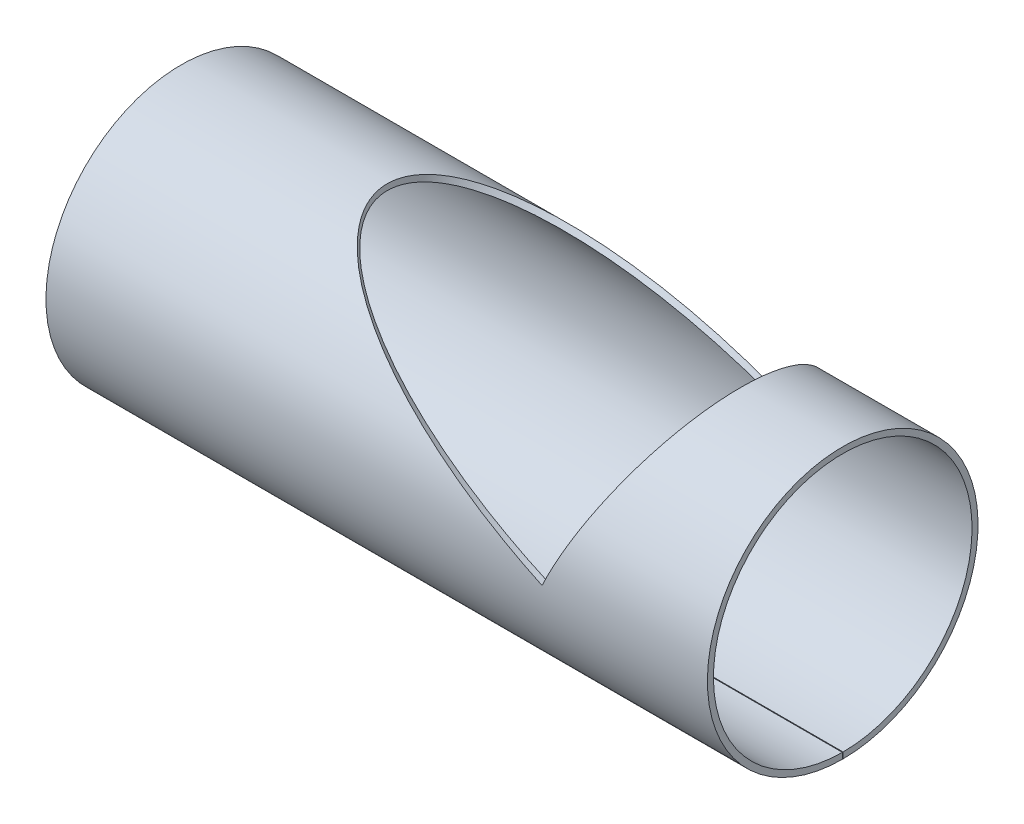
ISO-10303-21;
HEADER;
FILE_DESCRIPTION(('STEP AP214'),'2;1');
FILE_NAME('part.step','',(''),(''),'','','');
FILE_SCHEMA(('AUTOMOTIVE_DESIGN { 1 0 10303 214 1 1 1 1 }'));
ENDSEC;
DATA;
#1=APPLICATION_CONTEXT('core data for automotive mechanical design processes');
#2=APPLICATION_PROTOCOL_DEFINITION('international standard','automotive_design',2000,#1);
#3=PRODUCT_CONTEXT('',#1,'mechanical');
#4=PRODUCT('Part','Part','',(#3));
#5=PRODUCT_RELATED_PRODUCT_CATEGORY('part','',(#4));
#6=PRODUCT_DEFINITION_FORMATION('','',#4);
#7=PRODUCT_DEFINITION_CONTEXT('part definition',#1,'design');
#8=PRODUCT_DEFINITION('design','',#6,#7);
#9=PRODUCT_DEFINITION_SHAPE('','',#8);
#10=(LENGTH_UNIT() NAMED_UNIT(*) SI_UNIT(.MILLI.,.METRE.));
#11=(NAMED_UNIT(*) PLANE_ANGLE_UNIT() SI_UNIT($,.RADIAN.));
#12=(NAMED_UNIT(*) SI_UNIT($,.STERADIAN.) SOLID_ANGLE_UNIT());
#13=UNCERTAINTY_MEASURE_WITH_UNIT(LENGTH_MEASURE(1.E-05),#10,'distance_accuracy_value','');
#14=(GEOMETRIC_REPRESENTATION_CONTEXT(3) GLOBAL_UNCERTAINTY_ASSIGNED_CONTEXT((#13)) GLOBAL_UNIT_ASSIGNED_CONTEXT((#10,
#11,#12)) REPRESENTATION_CONTEXT('',''));
#15=CARTESIAN_POINT('',(0.,0.,0.));
#16=DIRECTION('',(0.,0.,1.));
#17=DIRECTION('',(1.,0.,0.));
#18=AXIS2_PLACEMENT_3D('',#15,#16,#17);
#19=CARTESIAN_POINT('',(3.5527136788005E-12,2.95933580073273E-12,-180.));
#20=CARTESIAN_POINT('',(2.4573984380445,5.26991145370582,-180.));
#21=CARTESIAN_POINT('',(4.47886343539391,9.60657418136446,-179.775815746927));
#22=CARTESIAN_POINT('',(6.46196042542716,13.8583122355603,-179.467752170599));
#23=CARTESIAN_POINT('',(6.83137340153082,14.6502794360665,-179.404324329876));
#24=CARTESIAN_POINT('',(7.34468323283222,15.7508284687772,-179.309918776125));
#25=CARTESIAN_POINT('',(7.50898490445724,16.10311175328,-179.278567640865));
#26=CARTESIAN_POINT('',(7.82398503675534,16.7785787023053,-179.216612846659));
#27=CARTESIAN_POINT('',(7.97474563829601,17.1018982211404,-179.186026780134));
#28=CARTESIAN_POINT('',(8.73422285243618,18.7306392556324,-179.027587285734));
#29=CARTESIAN_POINT('',(9.32822204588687,20.0045840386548,-178.88931784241));
#30=CARTESIAN_POINT('',(11.0694718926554,23.73897662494,-178.445360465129));
#31=CARTESIAN_POINT('',(12.1759748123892,26.1119284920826,-178.110604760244));
#32=CARTESIAN_POINT('',(13.7542337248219,29.4963069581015,-177.57047322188));
#33=CARTESIAN_POINT('',(14.266737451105,30.5952725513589,-177.384076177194));
#34=CARTESIAN_POINT('',(15.2645797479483,32.7350199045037,-177.001693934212));
#35=CARTESIAN_POINT('',(15.7477032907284,33.7710859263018,-176.806694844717));
#36=CARTESIAN_POINT('',(18.1398250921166,38.9011870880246,-175.795890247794));
#37=CARTESIAN_POINT('',(19.9560227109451,42.7961766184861,-174.880076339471));
#38=CARTESIAN_POINT('',(22.5340694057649,48.3245121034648,-173.402364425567));
#39=CARTESIAN_POINT('',(23.366033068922,50.1086108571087,-172.894420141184));
#40=CARTESIAN_POINT('',(25.0013993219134,53.6157553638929,-171.839181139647));
#41=CARTESIAN_POINT('',(25.8039465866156,55.3368993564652,-171.292139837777));
#42=CARTESIAN_POINT('',(28.166180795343,60.4027929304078,-169.600061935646));
#43=CARTESIAN_POINT('',(29.6779142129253,63.6444730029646,-168.406345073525));
#44=CARTESIAN_POINT('',(32.5913167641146,69.8923523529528,-165.910744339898));
#45=CARTESIAN_POINT('',(34.0031986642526,72.9202777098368,-164.599766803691));
#46=CARTESIAN_POINT('',(36.7373237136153,78.7835275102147,-161.875278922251));
#47=CARTESIAN_POINT('',(38.0568075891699,81.613074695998,-160.464985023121));
#48=CARTESIAN_POINT('',(40.6232801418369,87.1170198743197,-157.544692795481));
#49=CARTESIAN_POINT('',(41.8699960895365,89.7906391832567,-156.034563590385));
#50=CARTESIAN_POINT('',(44.2903873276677,94.9810661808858,-152.930510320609));
#51=CARTESIAN_POINT('',(45.4623694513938,97.4943270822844,-151.339177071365));
#52=CARTESIAN_POINT('',(47.7486324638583,102.397804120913,-148.065458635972));
#53=CARTESIAN_POINT('',(48.8614978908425,104.784757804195,-146.384768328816));
#54=CARTESIAN_POINT('',(52.1092959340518,111.750224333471,-141.227726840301));
#55=CARTESIAN_POINT('',(54.153430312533,116.133004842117,-137.6366104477));
#56=CARTESIAN_POINT('',(57.0380354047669,122.318289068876,-132.082981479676));
#57=CARTESIAN_POINT('',(57.9679643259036,124.312673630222,-130.206630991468));
#58=CARTESIAN_POINT('',(59.7768770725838,128.192517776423,-126.388630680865));
#59=CARTESIAN_POINT('',(60.6552997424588,130.076662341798,-124.447902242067));
#60=CARTESIAN_POINT('',(63.2124666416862,135.561109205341,-118.541383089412));
#61=CARTESIAN_POINT('',(64.8131097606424,138.993230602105,-114.491362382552));
#62=CARTESIAN_POINT('',(67.8061263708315,145.410558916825,-106.222217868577));
#63=CARTESIAN_POINT('',(69.1962433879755,148.391957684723,-102.010046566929));
#64=CARTESIAN_POINT('',(71.7881966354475,153.951415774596,-93.4086949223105));
#65=CARTESIAN_POINT('',(72.9882309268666,156.525066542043,-89.0240900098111));
#66=CARTESIAN_POINT('',(76.3005068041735,163.627183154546,-75.6814717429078));
#67=CARTESIAN_POINT('',(78.1217258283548,167.533486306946,-66.5520439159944));
#68=CARTESIAN_POINT('',(80.3078988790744,172.222051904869,-52.5711492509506));
#69=CARTESIAN_POINT('',(80.9445714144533,173.58695508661,-47.8675559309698));
#70=CARTESIAN_POINT('',(82.0338128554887,175.922024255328,-38.4080104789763));
#71=CARTESIAN_POINT('',(82.4861329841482,176.892189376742,-33.6545685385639));
#72=CARTESIAN_POINT('',(83.5728652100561,179.223736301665,-19.3069658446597));
#73=CARTESIAN_POINT('',(83.9351989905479,179.999622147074,-9.64334044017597));
#74=CARTESIAN_POINT('',(83.9355578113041,180.000377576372,9.62922947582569));
#75=CARTESIAN_POINT('',(83.573569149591,179.22525348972,19.2929635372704));
#76=CARTESIAN_POINT('',(82.4873340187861,176.894772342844,33.641001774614));
#77=CARTESIAN_POINT('',(82.0351795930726,175.924950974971,38.394617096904));
#78=CARTESIAN_POINT('',(80.9462468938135,173.590541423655,47.854560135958));
#79=CARTESIAN_POINT('',(80.3097167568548,172.225949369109,52.5583962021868));
#80=CARTESIAN_POINT('',(78.1239349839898,167.538235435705,66.5401401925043));
#81=CARTESIAN_POINT('',(76.3029444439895,163.632400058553,75.6702671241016));
#82=CARTESIAN_POINT('',(72.990884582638,156.530756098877,89.0141017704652));
#83=CARTESIAN_POINT('',(71.7909010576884,153.957220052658,93.3991476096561));
#84=CARTESIAN_POINT('',(69.1990068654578,148.397889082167,102.001435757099));
#85=CARTESIAN_POINT('',(67.8089054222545,145.416513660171,106.214084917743));
#86=CARTESIAN_POINT('',(64.8158754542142,138.999154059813,114.484188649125));
#87=CARTESIAN_POINT('',(63.215200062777,135.566966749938,118.534704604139));
#88=CARTESIAN_POINT('',(60.6579463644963,130.082337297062,124.441975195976));
#89=CARTESIAN_POINT('',(59.7794883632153,128.198117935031,126.382955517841));
#90=CARTESIAN_POINT('',(57.9704921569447,124.318095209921,130.201459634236));
#91=CARTESIAN_POINT('',(57.0405211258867,122.323619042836,132.078050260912));
#92=CARTESIAN_POINT('',(54.1557733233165,116.138028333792,137.632390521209));
#93=CARTESIAN_POINT('',(52.1115158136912,111.754985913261,141.223980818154));
#94=CARTESIAN_POINT('',(48.8634910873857,104.789034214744,146.38171237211));
#95=CARTESIAN_POINT('',(47.7505431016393,102.401903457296,148.062629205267));
#96=CARTESIAN_POINT('',(45.4641009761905,97.498041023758,151.336789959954));
#97=CARTESIAN_POINT('',(44.2920276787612,94.9845832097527,152.92833195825));
#98=CARTESIAN_POINT('',(41.871423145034,89.7936991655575,156.032808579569));
#99=CARTESIAN_POINT('',(40.6245848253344,87.1198182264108,157.543152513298));
#100=CARTESIAN_POINT('',(38.0578360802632,81.6152805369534,160.463870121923));
#101=CARTESIAN_POINT('',(36.7382026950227,78.7854117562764,161.874370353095));
#102=CARTESIAN_POINT('',(34.0037293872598,72.9214158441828,164.599270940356));
#103=CARTESIAN_POINT('',(32.5916507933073,69.8930692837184,165.910452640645));
#104=CARTESIAN_POINT('',(29.6778097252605,63.644248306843,168.406440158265));
#105=CARTESIAN_POINT('',(28.1658265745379,60.4020329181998,169.600346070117));
#106=CARTESIAN_POINT('',(25.8031604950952,55.3352136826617,171.292687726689));
#107=CARTESIAN_POINT('',(25.0004603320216,53.6137418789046,171.839813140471));
#108=CARTESIAN_POINT('',(23.3647703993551,50.1059029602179,172.895208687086));
#109=CARTESIAN_POINT('',(22.5326245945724,48.3214131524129,173.403231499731));
#110=CARTESIAN_POINT('',(19.9541396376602,42.7921331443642,174.881079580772));
#111=CARTESIAN_POINT('',(18.1377541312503,38.8967358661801,175.796878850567));
#112=CARTESIAN_POINT('',(15.7455278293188,33.7664191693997,176.807586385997));
#113=CARTESIAN_POINT('',(15.2623724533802,32.7302877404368,177.002569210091));
#114=CARTESIAN_POINT('',(14.264499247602,30.5904768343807,177.384903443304));
#115=CARTESIAN_POINT('',(13.7519999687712,29.4915212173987,177.571267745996));
#116=CARTESIAN_POINT('',(12.1738141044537,26.1072992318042,178.111281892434));
#117=CARTESIAN_POINT('',(11.0674394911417,23.7346205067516,178.44593353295));
#118=CARTESIAN_POINT('',(9.32650151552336,20.000894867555,178.88972875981));
#119=CARTESIAN_POINT('',(8.73262618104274,18.7272152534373,179.027943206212));
#120=CARTESIAN_POINT('',(7.9733286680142,17.098859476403,179.186316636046));
#121=CARTESIAN_POINT('',(7.82260492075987,16.7756190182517,179.216889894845));
#122=CARTESIAN_POINT('',(7.50761301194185,16.1001700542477,179.278831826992));
#123=CARTESIAN_POINT('',(7.34331886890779,15.7479030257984,179.310175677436));
#124=CARTESIAN_POINT('',(6.83004187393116,14.6474245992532,179.404557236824));
#125=CARTESIAN_POINT('',(6.46066445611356,13.8555335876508,179.467966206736));
#126=CARTESIAN_POINT('',(4.47781359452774,9.60432269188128,179.775927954));
#127=CARTESIAN_POINT('',(2.45676390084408,5.26855055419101,180.));
#128=CARTESIAN_POINT('',(3.5527136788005E-12,-3.95925245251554E-12,180.));
#129=CARTESIAN_POINT('',(3.5527136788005E-12,2.82996853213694E-12,-172.));
#130=CARTESIAN_POINT('',(2.45739316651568,5.03568236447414,-172.));
#131=CARTESIAN_POINT('',(4.47886343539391,9.17961532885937,-171.785779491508));
#132=CARTESIAN_POINT('',(6.46196042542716,13.2423872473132,-171.491407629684));
#133=CARTESIAN_POINT('',(6.83137340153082,13.9991559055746,-171.430798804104));
#134=CARTESIAN_POINT('',(7.34468323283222,15.0507916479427,-171.340589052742));
#135=CARTESIAN_POINT('',(7.50898490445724,15.3874178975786,-171.310631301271));
#136=CARTESIAN_POINT('',(7.82398503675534,16.032864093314,-171.251430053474));
#137=CARTESIAN_POINT('',(7.97474563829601,16.3418138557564,-171.222203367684));
#138=CARTESIAN_POINT('',(8.73422285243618,17.8981663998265,-171.07080562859));
#139=CARTESIAN_POINT('',(9.32822204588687,19.1154914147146,-170.938681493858));
#140=CARTESIAN_POINT('',(11.0694718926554,22.6839109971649,-170.514455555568));
#141=CARTESIAN_POINT('',(12.1759748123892,24.9513983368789,-170.194577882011));
#142=CARTESIAN_POINT('',(13.7542337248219,28.1853599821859,-169.678452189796));
#143=CARTESIAN_POINT('',(14.266737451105,29.2354826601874,-169.500339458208));
#144=CARTESIAN_POINT('',(15.2645797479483,31.2801301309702,-169.13495198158));
#145=CARTESIAN_POINT('',(15.7477032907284,32.2701487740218,-168.948619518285));
#146=CARTESIAN_POINT('',(18.1398250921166,37.172245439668,-167.982739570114));
#147=CARTESIAN_POINT('',(19.9560227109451,40.8941243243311,-167.107628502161));
#148=CARTESIAN_POINT('',(22.5340694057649,46.1767560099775,-165.695592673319));
#149=CARTESIAN_POINT('',(23.366033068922,47.8815614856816,-165.210223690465));
#150=CARTESIAN_POINT('',(25.0013993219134,51.2328329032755,-164.201884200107));
#151=CARTESIAN_POINT('',(25.8039465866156,52.8774816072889,-163.679155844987));
#152=CARTESIAN_POINT('',(28.1661807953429,57.718224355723,-162.062281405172));
#153=CARTESIAN_POINT('',(29.6779142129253,60.8158297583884,-160.921618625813));
#154=CARTESIAN_POINT('',(32.5913167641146,66.7860255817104,-158.536933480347));
#155=CARTESIAN_POINT('',(34.0031986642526,69.6793764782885,-157.284221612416));
#156=CARTESIAN_POINT('',(36.7373237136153,75.2820373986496,-154.680822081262));
#157=CARTESIAN_POINT('',(38.0568075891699,77.9858269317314,-153.333207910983));
#158=CARTESIAN_POINT('',(40.6232801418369,83.2451523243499,-150.542706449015));
#159=CARTESIAN_POINT('',(41.8699960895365,85.7999441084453,-149.099694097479));
#160=CARTESIAN_POINT('',(44.2903873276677,90.7596854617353,-146.133598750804));
#161=CARTESIAN_POINT('',(45.4623694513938,93.1612458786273,-144.612991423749));
#162=CARTESIAN_POINT('',(47.7486324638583,97.8467906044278,-141.484771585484));
#163=CARTESIAN_POINT('',(48.8614978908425,100.127657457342,-139.878778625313));
#164=CARTESIAN_POINT('',(52.1092959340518,106.783547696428,-134.950938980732));
#165=CARTESIAN_POINT('',(54.153430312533,110.971537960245,-131.519427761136));
#166=CARTESIAN_POINT('',(57.0380354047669,116.881920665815,-126.212626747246));
#167=CARTESIAN_POINT('',(57.9679643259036,118.787665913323,-124.41966961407));
#168=CARTESIAN_POINT('',(59.7768770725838,122.495072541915,-120.77135820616));
#169=CARTESIAN_POINT('',(60.6552997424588,124.295477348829,-118.916884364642));
#170=CARTESIAN_POINT('',(63.2124666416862,129.536171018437,-113.272877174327));
#171=CARTESIAN_POINT('',(64.8131097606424,132.815753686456,-109.402857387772));
#172=CARTESIAN_POINT('',(67.8061263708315,138.94786740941,-101.501230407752));
#173=CARTESIAN_POINT('',(69.1962433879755,141.796759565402,-97.4762667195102));
#174=CARTESIAN_POINT('',(71.7881966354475,147.109130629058,-89.2571973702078));
#175=CARTESIAN_POINT('',(72.9882309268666,149.568396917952,-85.0674637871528));
#176=CARTESIAN_POINT('',(76.3005068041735,156.354863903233,-72.3178507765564));
#177=CARTESIAN_POINT('',(78.1217258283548,160.087553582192,-63.5941752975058));
#178=CARTESIAN_POINT('',(80.3078988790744,164.567738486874,-50.2346537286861));
#179=CARTESIAN_POINT('',(80.9445714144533,165.871979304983,-45.7401090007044));
#180=CARTESIAN_POINT('',(82.0338128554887,168.103267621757,-36.7009877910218));
#181=CARTESIAN_POINT('',(82.4861329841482,169.030314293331,-32.15880993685));
#182=CARTESIAN_POINT('',(83.5728652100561,171.25823691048,-18.4488784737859));
#183=CARTESIAN_POINT('',(83.9351989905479,171.999638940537,-9.21474753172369));
#184=CARTESIAN_POINT('',(83.9355578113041,172.0003607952,9.20126372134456));
#185=CARTESIAN_POINT('',(83.573569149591,171.259686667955,18.4354984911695));
#186=CARTESIAN_POINT('',(82.4873340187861,169.03278246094,32.1458461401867));
#187=CARTESIAN_POINT('',(82.0351795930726,168.106064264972,36.6881896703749));
#188=CARTESIAN_POINT('',(80.9462468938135,165.875406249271,45.7276907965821));
#189=CARTESIAN_POINT('',(80.3097167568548,164.571462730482,50.2224674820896));
#190=CARTESIAN_POINT('',(78.1239349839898,160.092091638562,63.582800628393));
#191=CARTESIAN_POINT('',(76.3029444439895,156.35984894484,72.3071441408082));
#192=CARTESIAN_POINT('',(72.990884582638,149.573833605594,85.0579194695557));
#193=CARTESIAN_POINT('',(71.7909010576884,147.114676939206,89.2480743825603));
#194=CARTESIAN_POINT('',(69.1990068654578,141.802427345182,97.4680386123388));
#195=CARTESIAN_POINT('',(67.8089054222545,138.953557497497,101.493458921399));
#196=CARTESIAN_POINT('',(64.8158754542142,132.821413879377,109.396002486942));
#197=CARTESIAN_POINT('',(63.215200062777,129.541768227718,113.266495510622));
#198=CARTESIAN_POINT('',(60.6579463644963,124.300900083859,118.911220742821));
#199=CARTESIAN_POINT('',(59.7794883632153,122.500423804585,120.765935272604));
#200=CARTESIAN_POINT('',(57.9704921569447,118.792846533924,124.414728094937));
#201=CARTESIAN_POINT('',(57.0405211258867,116.887013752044,126.20791469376));
#202=CARTESIAN_POINT('',(54.1557733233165,110.976338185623,131.515395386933));
#203=CARTESIAN_POINT('',(52.1115158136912,106.78809765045,134.947359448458));
#204=CARTESIAN_POINT('',(48.8634910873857,100.1317438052,139.875858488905));
#205=CARTESIAN_POINT('',(47.7505431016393,97.8507077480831,141.482067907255));
#206=CARTESIAN_POINT('',(45.4641009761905,93.1647947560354,144.610710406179));
#207=CARTESIAN_POINT('',(44.2920276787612,90.7630461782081,146.13151720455));
#208=CARTESIAN_POINT('',(41.871423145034,85.8028680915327,149.098017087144));
#209=CARTESIAN_POINT('',(40.6245848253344,83.2478263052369,150.541234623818));
#210=CARTESIAN_POINT('',(38.0578360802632,77.987934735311,153.332142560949));
#211=CARTESIAN_POINT('',(36.7382026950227,75.2838379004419,154.679953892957));
#212=CARTESIAN_POINT('',(34.0037293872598,69.6804640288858,157.283747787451));
#213=CARTESIAN_POINT('',(32.5916507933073,66.7867106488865,158.536654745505));
#214=CARTESIAN_POINT('',(29.6778097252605,60.8156150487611,160.921709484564));
#215=CARTESIAN_POINT('',(28.1658265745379,57.7174981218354,162.062552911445));
#216=CARTESIAN_POINT('',(25.8031604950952,52.8758708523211,163.67967938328));
#217=CARTESIAN_POINT('',(25.0004603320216,51.2309089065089,164.202488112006));
#218=CARTESIAN_POINT('',(23.3647703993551,47.8789739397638,165.210977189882));
#219=CARTESIAN_POINT('',(22.5326245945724,46.1737947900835,165.696421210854));
#220=CARTESIAN_POINT('',(19.9541396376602,40.8902605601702,167.10858715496));
#221=CARTESIAN_POINT('',(18.1377541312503,37.1679920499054,167.983684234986));
#222=CARTESIAN_POINT('',(15.7455278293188,32.2656894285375,168.949471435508));
#223=CARTESIAN_POINT('',(15.2623724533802,31.2756082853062,169.13578835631));
#224=CARTESIAN_POINT('',(14.264499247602,29.230900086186,169.501129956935));
#225=CARTESIAN_POINT('',(13.7519999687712,28.1807869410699,169.679211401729));
#226=CARTESIAN_POINT('',(12.1738141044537,24.9469748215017,170.195224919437));
#227=CARTESIAN_POINT('',(11.0674394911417,22.6797484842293,170.515003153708));
#228=CARTESIAN_POINT('',(9.32650151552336,19.1119662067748,170.939074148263));
#229=CARTESIAN_POINT('',(8.73262618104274,17.8948945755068,171.07114573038));
#230=CARTESIAN_POINT('',(7.9733286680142,16.3389101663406,171.222480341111));
#231=CARTESIAN_POINT('',(7.82260492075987,16.0300359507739,171.251694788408));
#232=CARTESIAN_POINT('',(7.50761301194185,15.3846069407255,171.310883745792));
#233=CARTESIAN_POINT('',(7.34331886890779,15.0479962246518,171.340834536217));
#234=CARTESIAN_POINT('',(6.83004187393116,13.9964279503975,171.431021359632));
#235=CARTESIAN_POINT('',(6.46066445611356,13.2397320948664,171.491612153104));
#236=CARTESIAN_POINT('',(4.47781359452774,9.17746390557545,171.7858867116));
#237=CARTESIAN_POINT('',(2.45675863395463,5.03438195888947,172.));
#238=CARTESIAN_POINT('',(3.5527136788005E-12,-3.78112690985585E-12,172.));
#239=B_SPLINE_SURFACE_WITH_KNOTS('',1,3,((#19,#20,#21,#22,#23,#24,#25,#26,#27,#28,#29,#30,#31,
#32,#33,#34,#35,#36,#37,#38,#39,#40,#41,#42,#43,#44,#45,#46,#47,#48,#49,#50,#51,#52,#53,#54,#55,
#56,#57,#58,#59,#60,#61,#62,#63,#64,#65,#66,#67,#68,#69,#70,#71,#72,#73,#74,#75,#76,#77,#78,#79,
#80,#81,#82,#83,#84,#85,#86,#87,#88,#89,#90,#91,#92,#93,#94,#95,#96,#97,#98,#99,#100,#101,#102,
#103,#104,#105,#106,#107,#108,#109,#110,#111,#112,#113,#114,#115,#116,#117,#118,#119,#120,#121,
#122,#123,#124,#125,#126,#127,#128),(#129,#130,#131,#132,#133,#134,#135,#136,#137,#138,#139,
#140,#141,#142,#143,#144,#145,#146,#147,#148,#149,#150,#151,#152,#153,#154,#155,#156,#157,#158,
#159,#160,#161,#162,#163,#164,#165,#166,#167,#168,#169,#170,#171,#172,#173,#174,#175,#176,#177,
#178,#179,#180,#181,#182,#183,#184,#185,#186,#187,#188,#189,#190,#191,#192,#193,#194,#195,#196,
#197,#198,#199,#200,#201,#202,#203,#204,#205,#206,#207,#208,#209,#210,#211,#212,#213,#214,#215,
#216,#217,#218,#219,#220,#221,#222,#223,#224,#225,#226,#227,#228,#229,#230,#231,#232,#233,#234,
#235,#236,#237,#238)),.UNSPECIFIED.,.F.,.F.,.F.,(2,2),(4,2,2,2,2,2,2,2,2,2,2,2,2,2,2,2,2,2,2,2,
2,2,2,2,2,2,2,2,2,2,2,2,2,2,2,2,2,2,2,2,2,2,2,2,2,2,2,2,2,2,2,2,2,2,4),(0.,1.),(0.,0.0078125,
0.009765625,0.0107421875,0.01171875,0.015625,0.0234375,0.02734375,0.03125,0.046875,0.0546875,
0.0625,0.078125,0.09375,0.109375,0.125,0.140625,0.15625,0.1875,0.203125,0.21875,0.25,0.28125,
0.3125,0.375,0.40625,0.4375,0.5,0.5625,0.59375,0.625,0.6875,0.71875,0.75,0.78125,0.796875,
0.8125,0.84375,0.859375,0.875,0.890625,0.90625,0.921875,0.9375,0.9453125,0.953125,0.96875,
0.97265625,0.9765625,0.984375,0.98828125,0.9892578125,0.990234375,0.9921875,1.),.UNSPECIFIED.);
#240=CARTESIAN_POINT('',(3.5527136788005E-12,2.82996853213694E-12,-172.));
#241=CARTESIAN_POINT('',(3.5527136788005E-12,2.95933580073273E-12,-180.));
#242=B_SPLINE_CURVE_WITH_KNOTS('',1,(#240,#241),.UNSPECIFIED.,.F.,.F.,(2,2),(0.,1.),.UNSPECIFIED.);
#243=CARTESIAN_POINT('',(3.5527136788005E-12,2.82996853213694E-12,-172.));
#244=VERTEX_POINT('',#243);
#245=CARTESIAN_POINT('',(9.5729202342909E-08,2.05286749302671E-07,-180.));
#246=VERTEX_POINT('',#245);
#247=EDGE_CURVE('E13',#244,#246,#242,.T.);
#248=CARTESIAN_POINT('',(3.5527136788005E-12,2.82996853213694E-12,-172.));
#249=CARTESIAN_POINT('',(2.45739316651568,5.03568236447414,-172.));
#250=CARTESIAN_POINT('',(4.47886343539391,9.17961532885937,-171.785779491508));
#251=CARTESIAN_POINT('',(6.46196042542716,13.2423872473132,-171.491407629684));
#252=CARTESIAN_POINT('',(6.83137340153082,13.9991559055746,-171.430798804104));
#253=CARTESIAN_POINT('',(7.34468323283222,15.0507916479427,-171.340589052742));
#254=CARTESIAN_POINT('',(7.50898490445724,15.3874178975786,-171.310631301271));
#255=CARTESIAN_POINT('',(7.82398503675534,16.032864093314,-171.251430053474));
#256=CARTESIAN_POINT('',(7.97474563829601,16.3418138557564,-171.222203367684));
#257=CARTESIAN_POINT('',(8.73422285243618,17.8981663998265,-171.07080562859));
#258=CARTESIAN_POINT('',(9.32822204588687,19.1154914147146,-170.938681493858));
#259=CARTESIAN_POINT('',(11.0694718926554,22.6839109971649,-170.514455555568));
#260=CARTESIAN_POINT('',(12.1759748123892,24.9513983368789,-170.194577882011));
#261=CARTESIAN_POINT('',(13.7542337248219,28.1853599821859,-169.678452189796));
#262=CARTESIAN_POINT('',(14.266737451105,29.2354826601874,-169.500339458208));
#263=CARTESIAN_POINT('',(15.2645797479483,31.2801301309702,-169.13495198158));
#264=CARTESIAN_POINT('',(15.7477032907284,32.2701487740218,-168.948619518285));
#265=CARTESIAN_POINT('',(18.1398250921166,37.172245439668,-167.982739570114));
#266=CARTESIAN_POINT('',(19.9560227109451,40.8941243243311,-167.107628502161));
#267=CARTESIAN_POINT('',(22.5340694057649,46.1767560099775,-165.695592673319));
#268=CARTESIAN_POINT('',(23.366033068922,47.8815614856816,-165.210223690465));
#269=CARTESIAN_POINT('',(25.0013993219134,51.2328329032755,-164.201884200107));
#270=CARTESIAN_POINT('',(25.8039465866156,52.8774816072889,-163.679155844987));
#271=CARTESIAN_POINT('',(28.1661807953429,57.718224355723,-162.062281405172));
#272=CARTESIAN_POINT('',(29.6779142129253,60.8158297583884,-160.921618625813));
#273=CARTESIAN_POINT('',(32.5913167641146,66.7860255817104,-158.536933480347));
#274=CARTESIAN_POINT('',(34.0031986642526,69.6793764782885,-157.284221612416));
#275=CARTESIAN_POINT('',(36.7373237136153,75.2820373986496,-154.680822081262));
#276=CARTESIAN_POINT('',(38.0568075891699,77.9858269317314,-153.333207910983));
#277=CARTESIAN_POINT('',(40.6232801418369,83.2451523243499,-150.542706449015));
#278=CARTESIAN_POINT('',(41.8699960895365,85.7999441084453,-149.099694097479));
#279=CARTESIAN_POINT('',(44.2903873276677,90.7596854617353,-146.133598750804));
#280=CARTESIAN_POINT('',(45.4623694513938,93.1612458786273,-144.612991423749));
#281=CARTESIAN_POINT('',(47.7486324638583,97.8467906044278,-141.484771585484));
#282=CARTESIAN_POINT('',(48.8614978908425,100.127657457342,-139.878778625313));
#283=CARTESIAN_POINT('',(52.1092959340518,106.783547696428,-134.950938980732));
#284=CARTESIAN_POINT('',(54.153430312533,110.971537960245,-131.519427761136));
#285=CARTESIAN_POINT('',(57.0380354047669,116.881920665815,-126.212626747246));
#286=CARTESIAN_POINT('',(57.9679643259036,118.787665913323,-124.41966961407));
#287=CARTESIAN_POINT('',(59.7768770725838,122.495072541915,-120.77135820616));
#288=CARTESIAN_POINT('',(60.6552997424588,124.295477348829,-118.916884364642));
#289=CARTESIAN_POINT('',(63.2124666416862,129.536171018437,-113.272877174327));
#290=CARTESIAN_POINT('',(64.8131097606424,132.815753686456,-109.402857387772));
#291=CARTESIAN_POINT('',(67.8061263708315,138.94786740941,-101.501230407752));
#292=CARTESIAN_POINT('',(69.1962433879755,141.796759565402,-97.4762667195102));
#293=CARTESIAN_POINT('',(71.7881966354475,147.109130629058,-89.2571973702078));
#294=CARTESIAN_POINT('',(72.9882309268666,149.568396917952,-85.0674637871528));
#295=CARTESIAN_POINT('',(76.3005068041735,156.354863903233,-72.3178507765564));
#296=CARTESIAN_POINT('',(78.1217258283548,160.087553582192,-63.5941752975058));
#297=CARTESIAN_POINT('',(80.3078988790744,164.567738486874,-50.2346537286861));
#298=CARTESIAN_POINT('',(80.9445714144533,165.871979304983,-45.7401090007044));
#299=CARTESIAN_POINT('',(82.0338128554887,168.103267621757,-36.7009877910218));
#300=CARTESIAN_POINT('',(82.4861329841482,169.030314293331,-32.15880993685));
#301=CARTESIAN_POINT('',(83.5728652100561,171.25823691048,-18.4488784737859));
#302=CARTESIAN_POINT('',(83.9351989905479,171.999638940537,-9.21474753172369));
#303=CARTESIAN_POINT('',(83.9355578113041,172.0003607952,9.20126372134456));
#304=CARTESIAN_POINT('',(83.573569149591,171.259686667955,18.4354984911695));
#305=CARTESIAN_POINT('',(82.4873340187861,169.03278246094,32.1458461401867));
#306=CARTESIAN_POINT('',(82.0351795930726,168.106064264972,36.6881896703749));
#307=CARTESIAN_POINT('',(80.9462468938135,165.875406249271,45.7276907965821));
#308=CARTESIAN_POINT('',(80.3097167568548,164.571462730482,50.2224674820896));
#309=CARTESIAN_POINT('',(78.1239349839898,160.092091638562,63.582800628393));
#310=CARTESIAN_POINT('',(76.3029444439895,156.35984894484,72.3071441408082));
#311=CARTESIAN_POINT('',(72.990884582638,149.573833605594,85.0579194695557));
#312=CARTESIAN_POINT('',(71.7909010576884,147.114676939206,89.2480743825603));
#313=CARTESIAN_POINT('',(69.1990068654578,141.802427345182,97.4680386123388));
#314=CARTESIAN_POINT('',(67.8089054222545,138.953557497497,101.493458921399));
#315=CARTESIAN_POINT('',(64.8158754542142,132.821413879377,109.396002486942));
#316=CARTESIAN_POINT('',(63.215200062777,129.541768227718,113.266495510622));
#317=CARTESIAN_POINT('',(60.6579463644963,124.300900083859,118.911220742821));
#318=CARTESIAN_POINT('',(59.7794883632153,122.500423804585,120.765935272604));
#319=CARTESIAN_POINT('',(57.9704921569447,118.792846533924,124.414728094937));
#320=CARTESIAN_POINT('',(57.0405211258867,116.887013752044,126.20791469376));
#321=CARTESIAN_POINT('',(54.1557733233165,110.976338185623,131.515395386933));
#322=CARTESIAN_POINT('',(52.1115158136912,106.78809765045,134.947359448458));
#323=CARTESIAN_POINT('',(48.8634910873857,100.1317438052,139.875858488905));
#324=CARTESIAN_POINT('',(47.7505431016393,97.8507077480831,141.482067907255));
#325=CARTESIAN_POINT('',(45.4641009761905,93.1647947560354,144.610710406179));
#326=CARTESIAN_POINT('',(44.2920276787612,90.7630461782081,146.13151720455));
#327=CARTESIAN_POINT('',(41.871423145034,85.8028680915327,149.098017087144));
#328=CARTESIAN_POINT('',(40.6245848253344,83.2478263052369,150.541234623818));
#329=CARTESIAN_POINT('',(38.0578360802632,77.987934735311,153.332142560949));
#330=CARTESIAN_POINT('',(36.7382026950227,75.2838379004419,154.679953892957));
#331=CARTESIAN_POINT('',(34.0037293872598,69.6804640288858,157.283747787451));
#332=CARTESIAN_POINT('',(32.5916507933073,66.7867106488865,158.536654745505));
#333=CARTESIAN_POINT('',(29.6778097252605,60.8156150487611,160.921709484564));
#334=CARTESIAN_POINT('',(28.1658265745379,57.7174981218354,162.062552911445));
#335=CARTESIAN_POINT('',(25.8031604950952,52.8758708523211,163.67967938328));
#336=CARTESIAN_POINT('',(25.0004603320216,51.2309089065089,164.202488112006));
#337=CARTESIAN_POINT('',(23.3647703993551,47.8789739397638,165.210977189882));
#338=CARTESIAN_POINT('',(22.5326245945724,46.1737947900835,165.696421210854));
#339=CARTESIAN_POINT('',(19.9541396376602,40.8902605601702,167.10858715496));
#340=CARTESIAN_POINT('',(18.1377541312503,37.1679920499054,167.983684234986));
#341=CARTESIAN_POINT('',(15.7455278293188,32.2656894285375,168.949471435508));
#342=CARTESIAN_POINT('',(15.2623724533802,31.2756082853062,169.13578835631));
#343=CARTESIAN_POINT('',(14.264499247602,29.230900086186,169.501129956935));
#344=CARTESIAN_POINT('',(13.7519999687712,28.1807869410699,169.679211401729));
#345=CARTESIAN_POINT('',(12.1738141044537,24.9469748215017,170.195224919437));
#346=CARTESIAN_POINT('',(11.0674394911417,22.6797484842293,170.515003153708));
#347=CARTESIAN_POINT('',(9.32650151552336,19.1119662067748,170.939074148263));
#348=CARTESIAN_POINT('',(8.73262618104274,17.8948945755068,171.07114573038));
#349=CARTESIAN_POINT('',(7.9733286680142,16.3389101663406,171.222480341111));
#350=CARTESIAN_POINT('',(7.82260492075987,16.0300359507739,171.251694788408));
#351=CARTESIAN_POINT('',(7.50761301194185,15.3846069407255,171.310883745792));
#352=CARTESIAN_POINT('',(7.34331886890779,15.0479962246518,171.340834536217));
#353=CARTESIAN_POINT('',(6.83004187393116,13.9964279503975,171.431021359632));
#354=CARTESIAN_POINT('',(6.46066445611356,13.2397320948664,171.491612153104));
#355=CARTESIAN_POINT('',(4.47781359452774,9.17746390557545,171.7858867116));
#356=CARTESIAN_POINT('',(2.45675863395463,5.03438195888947,172.));
#357=CARTESIAN_POINT('',(3.5527136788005E-12,-3.78112690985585E-12,172.));
#358=B_SPLINE_CURVE_WITH_KNOTS('',3,(#248,#249,#250,#251,#252,#253,#254,#255,#256,#257,#258,
#259,#260,#261,#262,#263,#264,#265,#266,#267,#268,#269,#270,#271,#272,#273,#274,#275,#276,#277,
#278,#279,#280,#281,#282,#283,#284,#285,#286,#287,#288,#289,#290,#291,#292,#293,#294,#295,#296,
#297,#298,#299,#300,#301,#302,#303,#304,#305,#306,#307,#308,#309,#310,#311,#312,#313,#314,#315,
#316,#317,#318,#319,#320,#321,#322,#323,#324,#325,#326,#327,#328,#329,#330,#331,#332,#333,#334,
#335,#336,#337,#338,#339,#340,#341,#342,#343,#344,#345,#346,#347,#348,#349,#350,#351,#352,#353,
#354,#355,#356,#357),.UNSPECIFIED.,.F.,.F.,(4,2,2,2,2,2,2,2,2,2,2,2,2,2,2,2,2,2,2,2,2,2,2,2,2,2,
2,2,2,2,2,2,2,2,2,2,2,2,2,2,2,2,2,2,2,2,2,2,2,2,2,2,2,2,4),(0.,0.0078125,0.009765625,
0.0107421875,0.01171875,0.015625,0.0234375,0.02734375,0.03125,0.046875,0.0546875,0.0625,
0.078125,0.09375,0.109375,0.125,0.140625,0.15625,0.1875,0.203125,0.21875,0.25,0.28125,0.3125,
0.375,0.40625,0.4375,0.5,0.5625,0.59375,0.625,0.6875,0.71875,0.75,0.78125,0.796875,0.8125,
0.84375,0.859375,0.875,0.890625,0.90625,0.921875,0.9375,0.9453125,0.953125,0.96875,0.97265625,
0.9765625,0.984375,0.98828125,0.9892578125,0.990234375,0.9921875,1.),.UNSPECIFIED.);
#359=CARTESIAN_POINT('',(3.5527136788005E-12,-3.78112690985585E-12,172.));
#360=VERTEX_POINT('',#359);
#361=EDGE_CURVE('E250',#244,#360,#358,.T.);
#362=CARTESIAN_POINT('',(3.5527136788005E-12,-3.78112690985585E-12,172.));
#363=CARTESIAN_POINT('',(3.5527136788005E-12,-3.95925245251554E-12,180.));
#364=B_SPLINE_CURVE_WITH_KNOTS('',1,(#362,#363),.UNSPECIFIED.,.F.,.F.,(2,2),(0.,1.),.UNSPECIFIED.);
#365=CARTESIAN_POINT('',(9.5729202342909E-08,2.05280070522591E-07,180.));
#366=VERTEX_POINT('',#365);
#367=EDGE_CURVE('E53',#360,#366,#364,.T.);
#368=CARTESIAN_POINT('',(3.5527136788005E-12,-3.95925245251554E-12,180.));
#369=CARTESIAN_POINT('',(2.45676390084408,5.26855055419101,180.));
#370=CARTESIAN_POINT('',(4.47781359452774,9.60432269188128,179.775927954));
#371=CARTESIAN_POINT('',(6.46066445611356,13.8555335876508,179.467966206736));
#372=CARTESIAN_POINT('',(6.83004187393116,14.6474245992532,179.404557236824));
#373=CARTESIAN_POINT('',(7.34331886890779,15.7479030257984,179.310175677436));
#374=CARTESIAN_POINT('',(7.50761301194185,16.1001700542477,179.278831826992));
#375=CARTESIAN_POINT('',(7.82260492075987,16.7756190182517,179.216889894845));
#376=CARTESIAN_POINT('',(7.9733286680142,17.098859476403,179.186316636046));
#377=CARTESIAN_POINT('',(8.73262618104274,18.7272152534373,179.027943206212));
#378=CARTESIAN_POINT('',(9.32650151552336,20.000894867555,178.88972875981));
#379=CARTESIAN_POINT('',(11.0674394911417,23.7346205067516,178.44593353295));
#380=CARTESIAN_POINT('',(12.1738141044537,26.1072992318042,178.111281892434));
#381=CARTESIAN_POINT('',(13.7519999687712,29.4915212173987,177.571267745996));
#382=CARTESIAN_POINT('',(14.264499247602,30.5904768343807,177.384903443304));
#383=CARTESIAN_POINT('',(15.2623724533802,32.7302877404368,177.002569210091));
#384=CARTESIAN_POINT('',(15.7455278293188,33.7664191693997,176.807586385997));
#385=CARTESIAN_POINT('',(18.1377541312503,38.8967358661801,175.796878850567));
#386=CARTESIAN_POINT('',(19.9541396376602,42.7921331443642,174.881079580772));
#387=CARTESIAN_POINT('',(22.5326245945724,48.3214131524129,173.403231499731));
#388=CARTESIAN_POINT('',(23.3647703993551,50.1059029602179,172.895208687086));
#389=CARTESIAN_POINT('',(25.0004603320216,53.6137418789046,171.839813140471));
#390=CARTESIAN_POINT('',(25.8031604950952,55.3352136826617,171.292687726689));
#391=CARTESIAN_POINT('',(28.1658265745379,60.4020329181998,169.600346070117));
#392=CARTESIAN_POINT('',(29.6778097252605,63.644248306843,168.406440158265));
#393=CARTESIAN_POINT('',(32.5916507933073,69.8930692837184,165.910452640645));
#394=CARTESIAN_POINT('',(34.0037293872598,72.9214158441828,164.599270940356));
#395=CARTESIAN_POINT('',(36.7382026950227,78.7854117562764,161.874370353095));
#396=CARTESIAN_POINT('',(38.0578360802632,81.6152805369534,160.463870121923));
#397=CARTESIAN_POINT('',(40.6245848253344,87.1198182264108,157.543152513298));
#398=CARTESIAN_POINT('',(41.871423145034,89.7936991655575,156.032808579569));
#399=CARTESIAN_POINT('',(44.2920276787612,94.9845832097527,152.92833195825));
#400=CARTESIAN_POINT('',(45.4641009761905,97.498041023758,151.336789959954));
#401=CARTESIAN_POINT('',(47.7505431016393,102.401903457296,148.062629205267));
#402=CARTESIAN_POINT('',(48.8634910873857,104.789034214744,146.38171237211));
#403=CARTESIAN_POINT('',(52.1115158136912,111.754985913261,141.223980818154));
#404=CARTESIAN_POINT('',(54.1557733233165,116.138028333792,137.632390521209));
#405=CARTESIAN_POINT('',(57.0405211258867,122.323619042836,132.078050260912));
#406=CARTESIAN_POINT('',(57.9704921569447,124.318095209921,130.201459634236));
#407=CARTESIAN_POINT('',(59.7794883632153,128.198117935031,126.382955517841));
#408=CARTESIAN_POINT('',(60.6579463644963,130.082337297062,124.441975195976));
#409=CARTESIAN_POINT('',(63.215200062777,135.566966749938,118.534704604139));
#410=CARTESIAN_POINT('',(64.8158754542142,138.999154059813,114.484188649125));
#411=CARTESIAN_POINT('',(67.8089054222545,145.416513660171,106.214084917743));
#412=CARTESIAN_POINT('',(69.1990068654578,148.397889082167,102.001435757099));
#413=CARTESIAN_POINT('',(71.7909010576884,153.957220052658,93.3991476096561));
#414=CARTESIAN_POINT('',(72.990884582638,156.530756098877,89.0141017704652));
#415=CARTESIAN_POINT('',(76.3029444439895,163.632400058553,75.6702671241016));
#416=CARTESIAN_POINT('',(78.1239349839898,167.538235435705,66.5401401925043));
#417=CARTESIAN_POINT('',(80.3097167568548,172.225949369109,52.5583962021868));
#418=CARTESIAN_POINT('',(80.9462468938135,173.590541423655,47.854560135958));
#419=CARTESIAN_POINT('',(82.0351795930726,175.924950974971,38.394617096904));
#420=CARTESIAN_POINT('',(82.4873340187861,176.894772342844,33.641001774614));
#421=CARTESIAN_POINT('',(83.573569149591,179.22525348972,19.2929635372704));
#422=CARTESIAN_POINT('',(83.9355578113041,180.000377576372,9.62922947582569));
#423=CARTESIAN_POINT('',(83.9351989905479,179.999622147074,-9.64334044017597));
#424=CARTESIAN_POINT('',(83.5728652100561,179.223736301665,-19.3069658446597));
#425=CARTESIAN_POINT('',(82.4861329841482,176.892189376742,-33.6545685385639));
#426=CARTESIAN_POINT('',(82.0338128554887,175.922024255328,-38.4080104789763));
#427=CARTESIAN_POINT('',(80.9445714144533,173.58695508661,-47.8675559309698));
#428=CARTESIAN_POINT('',(80.3078988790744,172.222051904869,-52.5711492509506));
#429=CARTESIAN_POINT('',(78.1217258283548,167.533486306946,-66.5520439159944));
#430=CARTESIAN_POINT('',(76.3005068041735,163.627183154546,-75.6814717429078));
#431=CARTESIAN_POINT('',(72.9882309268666,156.525066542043,-89.0240900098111));
#432=CARTESIAN_POINT('',(71.7881966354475,153.951415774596,-93.4086949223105));
#433=CARTESIAN_POINT('',(69.1962433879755,148.391957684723,-102.010046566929));
#434=CARTESIAN_POINT('',(67.8061263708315,145.410558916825,-106.222217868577));
#435=CARTESIAN_POINT('',(64.8131097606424,138.993230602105,-114.491362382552));
#436=CARTESIAN_POINT('',(63.2124666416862,135.561109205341,-118.541383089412));
#437=CARTESIAN_POINT('',(60.6552997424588,130.076662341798,-124.447902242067));
#438=CARTESIAN_POINT('',(59.7768770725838,128.192517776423,-126.388630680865));
#439=CARTESIAN_POINT('',(57.9679643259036,124.312673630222,-130.206630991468));
#440=CARTESIAN_POINT('',(57.0380354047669,122.318289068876,-132.082981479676));
#441=CARTESIAN_POINT('',(54.153430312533,116.133004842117,-137.6366104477));
#442=CARTESIAN_POINT('',(52.1092959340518,111.750224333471,-141.227726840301));
#443=CARTESIAN_POINT('',(48.8614978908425,104.784757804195,-146.384768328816));
#444=CARTESIAN_POINT('',(47.7486324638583,102.397804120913,-148.065458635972));
#445=CARTESIAN_POINT('',(45.4623694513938,97.4943270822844,-151.339177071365));
#446=CARTESIAN_POINT('',(44.2903873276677,94.9810661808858,-152.930510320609));
#447=CARTESIAN_POINT('',(41.8699960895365,89.7906391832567,-156.034563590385));
#448=CARTESIAN_POINT('',(40.6232801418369,87.1170198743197,-157.544692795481));
#449=CARTESIAN_POINT('',(38.0568075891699,81.613074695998,-160.464985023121));
#450=CARTESIAN_POINT('',(36.7373237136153,78.7835275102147,-161.875278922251));
#451=CARTESIAN_POINT('',(34.0031986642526,72.9202777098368,-164.599766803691));
#452=CARTESIAN_POINT('',(32.5913167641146,69.8923523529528,-165.910744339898));
#453=CARTESIAN_POINT('',(29.6779142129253,63.6444730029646,-168.406345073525));
#454=CARTESIAN_POINT('',(28.166180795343,60.4027929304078,-169.600061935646));
#455=CARTESIAN_POINT('',(25.8039465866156,55.3368993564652,-171.292139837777));
#456=CARTESIAN_POINT('',(25.0013993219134,53.6157553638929,-171.839181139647));
#457=CARTESIAN_POINT('',(23.366033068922,50.1086108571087,-172.894420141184));
#458=CARTESIAN_POINT('',(22.5340694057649,48.3245121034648,-173.402364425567));
#459=CARTESIAN_POINT('',(19.9560227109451,42.7961766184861,-174.880076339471));
#460=CARTESIAN_POINT('',(18.1398250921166,38.9011870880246,-175.795890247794));
#461=CARTESIAN_POINT('',(15.7477032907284,33.7710859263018,-176.806694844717));
#462=CARTESIAN_POINT('',(15.2645797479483,32.7350199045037,-177.001693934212));
#463=CARTESIAN_POINT('',(14.266737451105,30.5952725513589,-177.384076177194));
#464=CARTESIAN_POINT('',(13.7542337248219,29.4963069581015,-177.57047322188));
#465=CARTESIAN_POINT('',(12.1759748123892,26.1119284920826,-178.110604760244));
#466=CARTESIAN_POINT('',(11.0694718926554,23.73897662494,-178.445360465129));
#467=CARTESIAN_POINT('',(9.32822204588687,20.0045840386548,-178.88931784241));
#468=CARTESIAN_POINT('',(8.73422285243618,18.7306392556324,-179.027587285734));
#469=CARTESIAN_POINT('',(7.97474563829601,17.1018982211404,-179.186026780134));
#470=CARTESIAN_POINT('',(7.82398503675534,16.7785787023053,-179.216612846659));
#471=CARTESIAN_POINT('',(7.50898490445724,16.10311175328,-179.278567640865));
#472=CARTESIAN_POINT('',(7.34468323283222,15.7508284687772,-179.309918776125));
#473=CARTESIAN_POINT('',(6.83137340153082,14.6502794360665,-179.404324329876));
#474=CARTESIAN_POINT('',(6.46196042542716,13.8583122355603,-179.467752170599));
#475=CARTESIAN_POINT('',(4.47886343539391,9.60657418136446,-179.775815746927));
#476=CARTESIAN_POINT('',(2.4573984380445,5.26991145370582,-180.));
#477=CARTESIAN_POINT('',(3.5527136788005E-12,2.95933580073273E-12,-180.));
#478=B_SPLINE_CURVE_WITH_KNOTS('',3,(#368,#369,#370,#371,#372,#373,#374,#375,#376,#377,#378,
#379,#380,#381,#382,#383,#384,#385,#386,#387,#388,#389,#390,#391,#392,#393,#394,#395,#396,#397,
#398,#399,#400,#401,#402,#403,#404,#405,#406,#407,#408,#409,#410,#411,#412,#413,#414,#415,#416,
#417,#418,#419,#420,#421,#422,#423,#424,#425,#426,#427,#428,#429,#430,#431,#432,#433,#434,#435,
#436,#437,#438,#439,#440,#441,#442,#443,#444,#445,#446,#447,#448,#449,#450,#451,#452,#453,#454,
#455,#456,#457,#458,#459,#460,#461,#462,#463,#464,#465,#466,#467,#468,#469,#470,#471,#472,#473,
#474,#475,#476,#477),.UNSPECIFIED.,.F.,.F.,(4,2,2,2,2,2,2,2,2,2,2,2,2,2,2,2,2,2,2,2,2,2,2,2,2,2,
2,2,2,2,2,2,2,2,2,2,2,2,2,2,2,2,2,2,2,2,2,2,2,2,2,2,2,2,4),(0.,0.0078125,0.009765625,
0.0107421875,0.01171875,0.015625,0.0234375,0.02734375,0.03125,0.046875,0.0546875,0.0625,
0.078125,0.09375,0.109375,0.125,0.140625,0.15625,0.1875,0.203125,0.21875,0.25,0.28125,0.3125,
0.375,0.40625,0.4375,0.5,0.5625,0.59375,0.625,0.6875,0.71875,0.75,0.78125,0.796875,0.8125,
0.84375,0.859375,0.875,0.890625,0.90625,0.921875,0.9375,0.9453125,0.953125,0.96875,0.97265625,
0.9765625,0.984375,0.98828125,0.9892578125,0.990234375,0.9921875,1.),.UNSPECIFIED.);
#479=EDGE_CURVE('E126',#246,#366,#478,.F.);
#480=ORIENTED_EDGE('',*,*,#247,.F.);
#481=ORIENTED_EDGE('',*,*,#361,.T.);
#482=ORIENTED_EDGE('',*,*,#367,.T.);
#483=ORIENTED_EDGE('',*,*,#479,.F.);
#484=EDGE_LOOP('',(#480,#481,#482,#483));
#485=FACE_BOUND('',#484,.T.);
#486=ADVANCED_FACE('F39',(#485),#239,.T.);
#487=CARTESIAN_POINT('',(220.,0.,2.49691760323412E-13));
#488=DIRECTION('',(-1.,0.,0.));
#489=DIRECTION('',(0.,-1.,0.));
#490=AXIS2_PLACEMENT_3D('',#487,#488,#489);
#491=PLANE('',#490);
#492=DIRECTION('',(0.,-0.999996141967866,0.00277777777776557));
#493=VECTOR('',#492,1.);
#494=CARTESIAN_POINT('',(220.,-171.999336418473,0.477777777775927));
#495=LINE('',#494,#493);
#496=CARTESIAN_POINT('',(220.,-171.999336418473,0.477777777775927));
#497=VERTEX_POINT('',#496);
#498=CARTESIAN_POINT('',(220.,-179.999305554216,0.499999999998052));
#499=VERTEX_POINT('',#498);
#500=EDGE_CURVE('E103',#497,#499,#495,.T.);
#501=ORIENTED_EDGE('',*,*,#500,.F.);
#502=CARTESIAN_POINT('',(220.,0.,2.49691760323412E-13));
#503=DIRECTION('',(1.,0.,0.));
#504=DIRECTION('',(0.,1.,0.));
#505=AXIS2_PLACEMENT_3D('',#502,#503,#504);
#506=CIRCLE('',#505,172.);
#507=CARTESIAN_POINT('',(220.,-171.999336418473,-0.477777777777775));
#508=VERTEX_POINT('',#507);
#509=EDGE_CURVE('E251',#508,#497,#506,.T.);
#510=ORIENTED_EDGE('',*,*,#509,.F.);
#511=DIRECTION('',(0.,-0.999996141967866,-0.00277777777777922));
#512=VECTOR('',#511,1.);
#513=CARTESIAN_POINT('',(220.,-171.999336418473,-0.477777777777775));
#514=LINE('',#513,#512);
#515=CARTESIAN_POINT('',(220.,-179.999305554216,-0.500000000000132));
#516=VERTEX_POINT('',#515);
#517=EDGE_CURVE('E113',#508,#516,#514,.T.);
#518=ORIENTED_EDGE('',*,*,#517,.T.);
#519=CARTESIAN_POINT('',(220.,0.,2.49691760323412E-13));
#520=DIRECTION('',(-1.,0.,0.));
#521=DIRECTION('',(0.,-1.,0.));
#522=AXIS2_PLACEMENT_3D('',#519,#520,#521);
#523=CIRCLE('',#522,180.);
#524=EDGE_CURVE('E116',#516,#499,#523,.F.);
#525=ORIENTED_EDGE('',*,*,#524,.T.);
#526=EDGE_LOOP('',(#501,#510,#518,#525));
#527=FACE_BOUND('',#526,.T.);
#528=ADVANCED_FACE('F117',(#527),#491,.F.);
#529=CARTESIAN_POINT('',(-220.,-171.999336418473,-0.477777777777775));
#530=DIRECTION('',(0.,0.00277777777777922,-0.999996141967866));
#531=DIRECTION('',(1.,0.,0.));
#532=AXIS2_PLACEMENT_3D('',#529,#530,#531);
#533=PLANE('',#532);
#534=ORIENTED_EDGE('',*,*,#517,.F.);
#535=DIRECTION('',(1.,0.,0.));
#536=VECTOR('',#535,1.);
#537=CARTESIAN_POINT('',(-660.,-171.999336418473,-0.477777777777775));
#538=LINE('',#537,#536);
#539=CARTESIAN_POINT('',(-660.,-171.999336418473,-0.477777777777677));
#540=VERTEX_POINT('',#539);
#541=EDGE_CURVE('E252',#540,#508,#538,.T.);
#542=ORIENTED_EDGE('',*,*,#541,.F.);
#543=DIRECTION('',(0.,-0.999996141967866,-0.00277777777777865));
#544=VECTOR('',#543,1.);
#545=CARTESIAN_POINT('',(-660.,-171.999336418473,-0.477777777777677));
#546=LINE('',#545,#544);
#547=CARTESIAN_POINT('',(-660.,-179.999305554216,-0.499999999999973));
#548=VERTEX_POINT('',#547);
#549=EDGE_CURVE('E92',#540,#548,#546,.T.);
#550=ORIENTED_EDGE('',*,*,#549,.T.);
#551=DIRECTION('',(-1.,0.,0.));
#552=VECTOR('',#551,1.);
#553=CARTESIAN_POINT('',(1612.99140041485,-179.999305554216,-0.500000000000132));
#554=LINE('',#553,#552);
#555=EDGE_CURVE('E119',#548,#516,#554,.F.);
#556=ORIENTED_EDGE('',*,*,#555,.T.);
#557=EDGE_LOOP('',(#534,#542,#550,#556));
#558=FACE_BOUND('',#557,.T.);
#559=ADVANCED_FACE('F267',(#558),#533,.F.);
#560=CARTESIAN_POINT('',(-660.,0.,2.49691760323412E-13));
#561=DIRECTION('',(-1.,0.,0.));
#562=DIRECTION('',(0.,-1.,0.));
#563=AXIS2_PLACEMENT_3D('',#560,#561,#562);
#564=PLANE('',#563);
#565=ORIENTED_EDGE('',*,*,#549,.F.);
#566=CARTESIAN_POINT('',(-660.,0.,2.49691760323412E-13));
#567=DIRECTION('',(1.,0.,0.));
#568=DIRECTION('',(0.,1.,0.));
#569=AXIS2_PLACEMENT_3D('',#566,#567,#568);
#570=CIRCLE('',#569,172.);
#571=CARTESIAN_POINT('',(-660.,-171.999336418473,0.477777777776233));
#572=VERTEX_POINT('',#571);
#573=EDGE_CURVE('E135',#540,#572,#570,.T.);
#574=ORIENTED_EDGE('',*,*,#573,.T.);
#575=DIRECTION('',(0.,-0.999996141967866,0.00277777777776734));
#576=VECTOR('',#575,1.);
#577=CARTESIAN_POINT('',(-660.,-171.999336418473,0.477777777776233));
#578=LINE('',#577,#576);
#579=CARTESIAN_POINT('',(-660.,-179.999305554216,0.499999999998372));
#580=VERTEX_POINT('',#579);
#581=EDGE_CURVE('E200',#572,#580,#578,.T.);
#582=ORIENTED_EDGE('',*,*,#581,.T.);
#583=CARTESIAN_POINT('',(-660.,0.,2.49691760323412E-13));
#584=DIRECTION('',(-1.,0.,0.));
#585=DIRECTION('',(0.,-1.,0.));
#586=AXIS2_PLACEMENT_3D('',#583,#584,#585);
#587=CIRCLE('',#586,180.);
#588=EDGE_CURVE('E125',#548,#580,#587,.F.);
#589=ORIENTED_EDGE('',*,*,#588,.F.);
#590=EDGE_LOOP('',(#565,#574,#582,#589));
#591=FACE_BOUND('',#590,.T.);
#592=ADVANCED_FACE('F147',(#591),#564,.T.);
#593=CARTESIAN_POINT('',(-220.,-171.999336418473,0.477777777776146));
#594=DIRECTION('',(0.,-0.00277777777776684,-0.999996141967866));
#595=DIRECTION('',(1.,0.,0.));
#596=AXIS2_PLACEMENT_3D('',#593,#594,#595);
#597=PLANE('',#596);
#598=DIRECTION('',(1.,0.,0.));
#599=VECTOR('',#598,1.);
#600=CARTESIAN_POINT('',(-660.,-171.999336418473,0.477777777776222));
#601=LINE('',#600,#599);
#602=EDGE_CURVE('E109',#572,#497,#601,.T.);
#603=ORIENTED_EDGE('',*,*,#602,.T.);
#604=ORIENTED_EDGE('',*,*,#500,.T.);
#605=DIRECTION('',(-1.,0.,0.));
#606=VECTOR('',#605,1.);
#607=CARTESIAN_POINT('',(1612.99140041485,-179.999305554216,0.499999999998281));
#608=LINE('',#607,#606);
#609=EDGE_CURVE('E107',#580,#499,#608,.F.);
#610=ORIENTED_EDGE('',*,*,#609,.F.);
#611=ORIENTED_EDGE('',*,*,#581,.F.);
#612=EDGE_LOOP('',(#603,#604,#610,#611));
#613=FACE_BOUND('',#612,.T.);
#614=ADVANCED_FACE('F105',(#613),#597,.T.);
#615=CARTESIAN_POINT('',(3.5527136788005E-12,-3.95925245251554E-12,180.));
#616=CARTESIAN_POINT('',(-12.238964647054,5.70712559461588,180.));
#617=CARTESIAN_POINT('',(-21.4486124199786,10.0017164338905,179.745145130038));
#618=CARTESIAN_POINT('',(-28.4029698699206,13.2445160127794,179.512432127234));
#619=CARTESIAN_POINT('',(-29.154930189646,13.5951705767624,179.486198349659));
#620=CARTESIAN_POINT('',(-30.6610420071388,14.2974989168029,179.431618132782));
#621=CARTESIAN_POINT('',(-31.4083043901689,14.6459653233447,179.403500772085));
#622=CARTESIAN_POINT('',(-33.6327109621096,15.6832645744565,179.316805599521));
#623=CARTESIAN_POINT('',(-35.0924745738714,16.363997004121,179.255885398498));
#624=CARTESIAN_POINT('',(-39.4022431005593,18.3737563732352,179.064838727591));
#625=CARTESIAN_POINT('',(-42.1827257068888,19.6703392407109,178.926437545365));
#626=CARTESIAN_POINT('',(-47.5582980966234,22.1769567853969,178.633073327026));
#627=CARTESIAN_POINT('',(-50.1533878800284,23.3869927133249,178.478110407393));
#628=CARTESIAN_POINT('',(-55.1581746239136,25.720666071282,178.156769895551));
#629=CARTESIAN_POINT('',(-57.5608029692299,26.8410444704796,177.991065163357));
#630=CARTESIAN_POINT('',(-64.6973153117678,30.1689392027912,177.46796582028));
#631=CARTESIAN_POINT('',(-69.2936580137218,32.3123076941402,177.088547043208));
#632=CARTESIAN_POINT('',(-75.9461737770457,35.414367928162,176.484934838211));
#633=CARTESIAN_POINT('',(-78.1233459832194,36.4295633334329,176.277975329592));
#634=CARTESIAN_POINT('',(-82.3970242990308,38.4223611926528,175.854371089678));
#635=CARTESIAN_POINT('',(-84.4894440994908,39.3980720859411,175.638193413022));
#636=CARTESIAN_POINT('',(-90.7057186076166,42.2968149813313,174.971173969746));
#637=CARTESIAN_POINT('',(-94.7528173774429,44.18406182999,174.503291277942));
#638=CARTESIAN_POINT('',(-102.652846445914,47.8678909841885,173.528945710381));
#639=CARTESIAN_POINT('',(-106.505776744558,49.6644749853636,173.022483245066));
#640=CARTESIAN_POINT('',(-114.017468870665,53.1672072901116,171.978451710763));
#641=CARTESIAN_POINT('',(-117.696134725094,54.8826511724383,171.438170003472));
#642=CARTESIAN_POINT('',(-124.924375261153,58.2532758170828,170.322363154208));
#643=CARTESIAN_POINT('',(-128.469922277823,59.9065801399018,169.747394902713));
#644=CARTESIAN_POINT('',(-135.423869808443,63.1492021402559,168.567952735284));
#645=CARTESIAN_POINT('',(-138.826980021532,64.7360730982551,167.964475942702));
#646=CARTESIAN_POINT('',(-148.878725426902,69.4233556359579,166.107480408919));
#647=CARTESIAN_POINT('',(-155.369096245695,72.4499169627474,164.807180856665));
#648=CARTESIAN_POINT('',(-167.928252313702,78.3061935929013,162.106561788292));
#649=CARTESIAN_POINT('',(-174.0041582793,81.1394515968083,160.704991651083));
#650=CARTESIAN_POINT('',(-185.82551602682,86.6518640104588,157.801012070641));
#651=CARTESIAN_POINT('',(-191.553894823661,89.3229972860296,156.302662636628));
#652=CARTESIAN_POINT('',(-202.690165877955,94.5160116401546,153.218287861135));
#653=CARTESIAN_POINT('',(-208.103764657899,97.0404473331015,151.630508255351));
#654=CARTESIAN_POINT('',(-218.621888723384,101.945068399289,148.377432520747));
#655=CARTESIAN_POINT('',(-223.723369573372,104.323942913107,146.713262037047));
#656=CARTESIAN_POINT('',(-238.624689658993,111.272627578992,141.603204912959));
#657=CARTESIAN_POINT('',(-247.988528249,115.638967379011,138.05153322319));
#658=CARTESIAN_POINT('',(-265.698689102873,123.897440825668,130.690553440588));
#659=CARTESIAN_POINT('',(-274.028805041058,127.781678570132,126.888338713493));
#660=CARTESIAN_POINT('',(-289.754341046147,135.115122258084,119.04919830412));
#661=CARTESIAN_POINT('',(-297.142333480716,138.559580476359,115.016392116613));
#662=CARTESIAN_POINT('',(-317.936517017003,148.25576878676,102.617436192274));
#663=CARTESIAN_POINT('',(-329.975705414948,153.87013117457,93.949936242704));
#664=CARTESIAN_POINT('',(-345.366633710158,161.047052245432,80.5574261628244));
#665=CARTESIAN_POINT('',(-350.049725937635,163.231154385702,76.029914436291));
#666=CARTESIAN_POINT('',(-358.554435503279,167.196931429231,66.8591337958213));
#667=CARTESIAN_POINT('',(-362.371589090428,168.976499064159,62.2197993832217));
#668=CARTESIAN_POINT('',(-372.522040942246,173.710049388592,48.1898477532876));
#669=CARTESIAN_POINT('',(-377.586213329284,176.071230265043,38.6482349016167));
#670=CARTESIAN_POINT('',(-384.321928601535,179.21240694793,19.4339235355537));
#671=CARTESIAN_POINT('',(-386.005073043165,179.99712867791,9.74229881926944));
#672=CARTESIAN_POINT('',(-386.017384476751,180.002855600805,-9.6359065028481));
#673=CARTESIAN_POINT('',(-384.346511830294,179.223873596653,-19.3282395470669));
#674=CARTESIAN_POINT('',(-377.634461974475,176.093731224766,-38.5457589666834));
#675=CARTESIAN_POINT('',(-372.581865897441,173.737968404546,-48.0892728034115));
#676=CARTESIAN_POINT('',(-362.447862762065,169.012059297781,-62.1231741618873));
#677=CARTESIAN_POINT('',(-358.636265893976,167.235083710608,-66.7636754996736));
#678=CARTESIAN_POINT('',(-350.142045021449,163.274210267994,-75.9374337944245));
#679=CARTESIAN_POINT('',(-345.46404379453,161.092473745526,-80.4665823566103));
#680=CARTESIAN_POINT('',(-330.088050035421,153.922515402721,-93.8641739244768));
#681=CARTESIAN_POINT('',(-318.057737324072,148.312294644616,-102.535814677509));
#682=CARTESIAN_POINT('',(-297.276316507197,138.622044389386,-114.941121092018));
#683=CARTESIAN_POINT('',(-289.892660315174,135.179633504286,-118.975954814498));
#684=CARTESIAN_POINT('',(-274.175325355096,127.850011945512,-126.819500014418));
#685=CARTESIAN_POINT('',(-265.849601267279,123.967808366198,-130.623822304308));
#686=CARTESIAN_POINT('',(-248.146773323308,115.712764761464,-137.989697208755));
#687=CARTESIAN_POINT('',(-238.786429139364,111.348046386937,-141.543929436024));
#688=CARTESIAN_POINT('',(-223.889531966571,104.40142834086,-146.658138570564));
#689=CARTESIAN_POINT('',(-218.789515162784,102.023231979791,-148.323703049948));
#690=CARTESIAN_POINT('',(-208.274265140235,97.1199542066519,-151.579600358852));
#691=CARTESIAN_POINT('',(-202.861867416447,94.5960832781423,-153.168873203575));
#692=CARTESIAN_POINT('',(-191.727526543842,89.4039635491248,-156.256372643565));
#693=CARTESIAN_POINT('',(-186.000235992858,86.7333414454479,-157.756265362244));
#694=CARTESIAN_POINT('',(-174.177862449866,81.2204720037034,-160.664080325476));
#695=CARTESIAN_POINT('',(-168.100241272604,78.3863899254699,-162.067837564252));
#696=CARTESIAN_POINT('',(-155.536217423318,72.5278262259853,-164.772948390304));
#697=CARTESIAN_POINT('',(-149.041759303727,69.4993786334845,-166.075756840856));
#698=CARTESIAN_POINT('',(-138.981402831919,64.8080833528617,-167.936721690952));
#699=CARTESIAN_POINT('',(-135.575465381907,63.2198899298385,-168.541472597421));
#700=CARTESIAN_POINT('',(-128.61549310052,59.9744591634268,-169.723441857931));
#701=CARTESIAN_POINT('',(-125.066677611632,58.3196325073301,-170.299673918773));
#702=CARTESIAN_POINT('',(-117.831387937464,54.9457226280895,-171.41798633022));
#703=CARTESIAN_POINT('',(-114.148448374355,53.2282855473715,-171.95957707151));
#704=CARTESIAN_POINT('',(-106.629957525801,49.7223785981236,-173.005871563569));
#705=CARTESIAN_POINT('',(-102.77326803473,47.9240428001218,-173.513470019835));
#706=CARTESIAN_POINT('',(-94.8650009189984,44.2363745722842,-174.490060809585));
#707=CARTESIAN_POINT('',(-90.8134232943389,42.3470404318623,-174.959052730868));
#708=CARTESIAN_POINT('',(-84.5898907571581,39.4449116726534,-175.627686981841));
#709=CARTESIAN_POINT('',(-82.4952250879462,38.4681519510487,-175.844366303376));
#710=CARTESIAN_POINT('',(-78.2172437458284,36.4733466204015,-176.268927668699));
#711=CARTESIAN_POINT('',(-76.0377703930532,35.457078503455,-176.476366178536));
#712=CARTESIAN_POINT('',(-69.3779022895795,32.3515914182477,-177.081403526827));
#713=CARTESIAN_POINT('',(-64.7760594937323,30.2056598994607,-177.461756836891));
#714=CARTESIAN_POINT('',(-57.6303992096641,26.8734984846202,-177.986177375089));
#715=CARTESIAN_POINT('',(-55.224841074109,25.7517522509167,-178.15228727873));
#716=CARTESIAN_POINT('',(-50.2149736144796,23.4157085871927,-178.474353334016));
#717=CARTESIAN_POINT('',(-47.6169996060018,22.2043283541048,-178.629683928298));
#718=CARTESIAN_POINT('',(-42.2349710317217,19.6947016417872,-178.923768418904));
#719=CARTESIAN_POINT('',(-39.4509164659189,18.39645390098,-179.062522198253));
#720=CARTESIAN_POINT('',(-35.1352741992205,16.3839558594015,-179.254065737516));
#721=CARTESIAN_POINT('',(-33.673466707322,15.702270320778,-179.31514620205));
#722=CARTESIAN_POINT('',(-31.4458653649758,14.6634810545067,-179.402070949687));
#723=CARTESIAN_POINT('',(-30.6975165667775,14.3145079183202,-179.430263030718));
#724=CARTESIAN_POINT('',(-29.1891889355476,13.6111460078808,-179.484988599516));
#725=CARTESIAN_POINT('',(-28.4352666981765,13.2595769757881,-179.511320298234));
#726=CARTESIAN_POINT('',(-21.480860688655,10.0167454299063,-179.744308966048));
#727=CARTESIAN_POINT('',(-12.2604514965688,5.71714493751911,-180.));
#728=CARTESIAN_POINT('',(3.5527136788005E-12,2.95933580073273E-12,-180.));
#729=CARTESIAN_POINT('',(3.5527136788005E-12,-3.78112690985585E-12,172.));
#730=CARTESIAN_POINT('',(-12.2389327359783,5.4534613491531,172.));
#731=CARTESIAN_POINT('',(-21.4486124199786,9.55719570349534,171.756472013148));
#732=CARTESIAN_POINT('',(-28.4029698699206,12.6558708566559,171.534101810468));
#733=CARTESIAN_POINT('',(-29.154930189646,12.9909407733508,171.509033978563));
#734=CARTESIAN_POINT('',(-30.6610420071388,13.6620545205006,171.456879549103));
#735=CARTESIAN_POINT('',(-31.4083043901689,13.9950335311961,171.430011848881));
#736=CARTESIAN_POINT('',(-33.6327109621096,14.9862305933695,171.347169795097));
#737=CARTESIAN_POINT('',(-35.0924745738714,15.6367082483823,171.288957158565));
#738=CARTESIAN_POINT('',(-39.4022431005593,17.5571449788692,171.106401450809));
#739=CARTESIAN_POINT('',(-42.1827257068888,18.7961019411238,170.974151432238));
#740=CARTESIAN_POINT('',(-47.5582980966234,21.1913142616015,170.693825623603));
#741=CARTESIAN_POINT('',(-50.1533878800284,22.3475708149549,170.545749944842));
#742=CARTESIAN_POINT('',(-55.1581746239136,24.5775253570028,170.238691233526));
#743=CARTESIAN_POINT('',(-57.5608029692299,25.6481091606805,170.080351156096));
#744=CARTESIAN_POINT('',(-64.6973153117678,28.828097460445,169.580500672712));
#745=CARTESIAN_POINT('',(-69.2936580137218,30.8762051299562,169.217944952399));
#746=CARTESIAN_POINT('',(-75.9461737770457,33.8403960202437,168.641159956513));
#747=CARTESIAN_POINT('',(-78.1233459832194,34.8104716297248,168.443398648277));
#748=CARTESIAN_POINT('',(-82.3970242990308,36.7147006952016,168.038621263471));
#749=CARTESIAN_POINT('',(-84.4894440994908,37.6470466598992,167.832051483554));
#750=CARTESIAN_POINT('',(-90.7057186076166,40.4169565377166,167.194677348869));
#751=CARTESIAN_POINT('',(-94.7528173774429,42.2203257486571,166.747589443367));
#752=CARTESIAN_POINT('',(-102.652846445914,45.740429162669,165.816548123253));
#753=CARTESIAN_POINT('',(-106.505776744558,47.4571649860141,165.332595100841));
#754=CARTESIAN_POINT('',(-114.017468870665,50.80422029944,164.334964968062));
#755=CARTESIAN_POINT('',(-117.696134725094,52.443422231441,163.818695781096));
#756=CARTESIAN_POINT('',(-124.924375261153,55.6642413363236,162.752480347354));
#757=CARTESIAN_POINT('',(-128.469922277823,57.2440654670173,162.20306624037));
#758=CARTESIAN_POINT('',(-135.423869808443,60.3425709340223,161.076043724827));
#759=CARTESIAN_POINT('',(-138.826980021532,61.8589142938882,160.499388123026));
#760=CARTESIAN_POINT('',(-148.878725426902,66.3378731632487,158.724925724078));
#761=CARTESIAN_POINT('',(-155.369096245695,69.229920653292,157.482417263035));
#762=CARTESIAN_POINT('',(-167.928252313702,74.8259183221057,154.901825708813));
#763=CARTESIAN_POINT('',(-174.0041582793,77.5332537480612,153.562547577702));
#764=CARTESIAN_POINT('',(-185.82551602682,82.8006700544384,150.78763375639));
#765=CARTESIAN_POINT('',(-191.553894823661,85.3530862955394,149.355877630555));
#766=CARTESIAN_POINT('',(-202.690165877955,90.3153000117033,146.408586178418));
#767=CARTESIAN_POINT('',(-208.103764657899,92.7275385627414,144.891374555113));
#768=CARTESIAN_POINT('',(-218.621888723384,97.4141764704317,141.782879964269));
#769=CARTESIAN_POINT('',(-223.723369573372,99.6873232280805,140.192672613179));
#770=CARTESIAN_POINT('',(-238.624689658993,106.32717746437,135.309729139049));
#771=CARTESIAN_POINT('',(-247.988528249,110.499457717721,131.915909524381));
#772=CARTESIAN_POINT('',(-265.698689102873,118.390887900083,124.882084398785));
#773=CARTESIAN_POINT('',(-274.028805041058,122.102492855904,121.248856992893));
#774=CARTESIAN_POINT('',(-289.754341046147,129.11000571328,113.758122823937));
#775=CARTESIAN_POINT('',(-297.142333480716,132.401376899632,109.904552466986));
#776=CARTESIAN_POINT('',(-317.936517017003,141.666623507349,98.0566612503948));
#777=CARTESIAN_POINT('',(-329.975705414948,147.031458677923,89.7743835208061));
#778=CARTESIAN_POINT('',(-345.366633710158,153.889405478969,76.9770961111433));
#779=CARTESIAN_POINT('',(-350.049725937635,155.976436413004,72.6508071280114));
#780=CARTESIAN_POINT('',(-358.554435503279,159.765956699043,63.8876167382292));
#781=CARTESIAN_POINT('',(-362.371589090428,161.466432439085,59.4544749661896));
#782=CARTESIAN_POINT('',(-372.522040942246,165.989602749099,46.0480767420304));
#783=CARTESIAN_POINT('',(-377.586213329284,168.245842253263,36.930535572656));
#784=CARTESIAN_POINT('',(-384.321928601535,171.247411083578,18.5701936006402));
#785=CARTESIAN_POINT('',(-386.005073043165,171.997256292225,9.30930776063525));
#786=CARTESIAN_POINT('',(-386.017384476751,172.002728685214,-9.20764399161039));
#787=CARTESIAN_POINT('',(-384.346511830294,171.258368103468,-18.4692066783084));
#788=CARTESIAN_POINT('',(-377.634461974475,168.267343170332,-36.8326141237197));
#789=CARTESIAN_POINT('',(-372.581865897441,166.016280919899,-45.9519717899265));
#790=CARTESIAN_POINT('',(-362.447862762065,161.50041221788,-59.3621441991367));
#791=CARTESIAN_POINT('',(-358.636265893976,159.80241332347,-63.7964010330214));
#792=CARTESIAN_POINT('',(-350.142045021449,156.017578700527,-72.5624367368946));
#793=CARTESIAN_POINT('',(-345.46404379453,153.932808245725,-76.8902898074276));
#794=CARTESIAN_POINT('',(-330.088050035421,147.081514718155,-89.6924328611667));
#795=CARTESIAN_POINT('',(-318.057737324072,141.720637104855,-97.9786673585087));
#796=CARTESIAN_POINT('',(-297.276316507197,132.461064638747,-109.832626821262));
#797=CARTESIAN_POINT('',(-289.892660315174,129.171649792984,-113.68813460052));
#798=CARTESIAN_POINT('',(-274.175325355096,122.167789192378,-121.183077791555));
#799=CARTESIAN_POINT('',(-265.849601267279,118.458127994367,-124.818319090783));
#800=CARTESIAN_POINT('',(-248.146773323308,110.56997521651,-131.856821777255));
#801=CARTESIAN_POINT('',(-238.786429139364,106.399244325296,-135.253088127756));
#802=CARTESIAN_POINT('',(-223.889531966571,99.761364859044,-140.139999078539));
#803=CARTESIAN_POINT('',(-218.789515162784,97.4888661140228,-141.731538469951));
#804=CARTESIAN_POINT('',(-208.274265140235,92.8035117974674,-144.842729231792));
#805=CARTESIAN_POINT('',(-202.861867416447,90.3918129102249,-146.36136772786));
#806=CARTESIAN_POINT('',(-191.727526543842,85.4304540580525,-149.311644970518));
#807=CARTESIAN_POINT('',(-186.000235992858,82.8785262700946,-150.744875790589));
#808=CARTESIAN_POINT('',(-174.177862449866,77.6106732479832,-153.523454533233));
#809=CARTESIAN_POINT('',(-168.100241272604,74.9025503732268,-154.864822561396));
#810=CARTESIAN_POINT('',(-155.536217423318,69.3043672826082,-157.449706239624));
#811=CARTESIAN_POINT('',(-149.041759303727,66.4105173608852,-158.694612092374));
#812=CARTESIAN_POINT('',(-138.981402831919,61.9277240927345,-160.472867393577));
#813=CARTESIAN_POINT('',(-135.575465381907,60.4101170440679,-161.05074048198));
#814=CARTESIAN_POINT('',(-128.61549310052,57.3089276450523,-162.180177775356));
#815=CARTESIAN_POINT('',(-125.066677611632,55.7276488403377,-162.730799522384));
#816=CARTESIAN_POINT('',(-117.831387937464,52.5036905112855,-163.799409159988));
#817=CARTESIAN_POINT('',(-114.148448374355,50.8625839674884,-164.316929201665));
#818=CARTESIAN_POINT('',(-106.629957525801,47.5124951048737,-165.316721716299));
#819=CARTESIAN_POINT('',(-102.77326803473,45.7940853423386,-165.801760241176));
#820=CARTESIAN_POINT('',(-94.8650009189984,42.2703134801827,-166.734946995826));
#821=CARTESIAN_POINT('',(-90.8134232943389,40.4649497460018,-167.183094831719));
#822=CARTESIAN_POINT('',(-84.5898907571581,37.6918044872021,-167.822012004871));
#823=CARTESIAN_POINT('',(-82.4952250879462,36.7584563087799,-168.029061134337));
#824=CARTESIAN_POINT('',(-78.2172437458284,34.852308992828,-168.434753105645));
#825=CARTESIAN_POINT('',(-76.0377703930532,33.8812083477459,-168.632972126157));
#826=CARTESIAN_POINT('',(-69.3779022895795,30.91374291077,-169.211118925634));
#827=CARTESIAN_POINT('',(-64.7760594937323,28.8631861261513,-169.574567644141));
#828=CARTESIAN_POINT('',(-57.6303992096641,25.6791207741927,-170.075680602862));
#829=CARTESIAN_POINT('',(-55.224841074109,24.6072299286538,-170.234407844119));
#830=CARTESIAN_POINT('',(-50.2149736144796,22.3750104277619,-170.542159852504));
#831=CARTESIAN_POINT('',(-47.6169996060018,21.2174693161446,-170.690586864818));
#832=CARTESIAN_POINT('',(-42.2349710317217,18.8193815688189,-170.971600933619));
#833=CARTESIAN_POINT('',(-39.4509164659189,17.5788337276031,-171.104187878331));
#834=CARTESIAN_POINT('',(-35.1352741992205,15.6557800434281,-171.287218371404));
#835=CARTESIAN_POINT('',(-33.673466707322,15.0043916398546,-171.345584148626));
#836=CARTESIAN_POINT('',(-31.4458653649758,14.0117707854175,-171.428645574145));
#837=CARTESIAN_POINT('',(-30.6975165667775,13.6783075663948,-171.455584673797));
#838=CARTESIAN_POINT('',(-29.1891889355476,13.0062061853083,-171.507877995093));
#839=CARTESIAN_POINT('',(-28.4352666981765,12.6702624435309,-171.53303939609));
#840=CARTESIAN_POINT('',(-21.480860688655,9.5715567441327,-171.755673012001));
#841=CARTESIAN_POINT('',(-12.2604194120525,5.46303531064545,-172.));
#842=CARTESIAN_POINT('',(3.5527136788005E-12,2.82996853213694E-12,-172.));
#843=B_SPLINE_SURFACE_WITH_KNOTS('',1,3,((#615,#616,#617,#618,#619,#620,#621,#622,#623,#624,
#625,#626,#627,#628,#629,#630,#631,#632,#633,#634,#635,#636,#637,#638,#639,#640,#641,#642,#643,
#644,#645,#646,#647,#648,#649,#650,#651,#652,#653,#654,#655,#656,#657,#658,#659,#660,#661,#662,
#663,#664,#665,#666,#667,#668,#669,#670,#671,#672,#673,#674,#675,#676,#677,#678,#679,#680,#681,
#682,#683,#684,#685,#686,#687,#688,#689,#690,#691,#692,#693,#694,#695,#696,#697,#698,#699,#700,
#701,#702,#703,#704,#705,#706,#707,#708,#709,#710,#711,#712,#713,#714,#715,#716,#717,#718,#719,
#720,#721,#722,#723,#724,#725,#726,#727,#728),(#729,#730,#731,#732,#733,#734,#735,#736,#737,
#738,#739,#740,#741,#742,#743,#744,#745,#746,#747,#748,#749,#750,#751,#752,#753,#754,#755,#756,
#757,#758,#759,#760,#761,#762,#763,#764,#765,#766,#767,#768,#769,#770,#771,#772,#773,#774,#775,
#776,#777,#778,#779,#780,#781,#782,#783,#784,#785,#786,#787,#788,#789,#790,#791,#792,#793,#794,
#795,#796,#797,#798,#799,#800,#801,#802,#803,#804,#805,#806,#807,#808,#809,#810,#811,#812,#813,
#814,#815,#816,#817,#818,#819,#820,#821,#822,#823,#824,#825,#826,#827,#828,#829,#830,#831,#832,
#833,#834,#835,#836,#837,#838,#839,#840,#841,#842)),.UNSPECIFIED.,.F.,.F.,.F.,(2,2),(4,2,2,2,2,
2,2,2,2,2,2,2,2,2,2,2,2,2,2,2,2,2,2,2,2,2,2,2,2,2,2,2,2,2,2,2,2,2,2,2,2,2,2,2,2,2,2,2,2,2,2,2,2,
2,2,2,4),(0.,1.),(0.,0.0078125,0.0087890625,0.009765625,0.01171875,0.015625,0.01953125,
0.0234375,0.03125,0.03515625,0.0390625,0.046875,0.0546875,0.0625,0.0703125,0.078125,0.09375,
0.109375,0.125,0.140625,0.15625,0.1875,0.21875,0.25,0.3125,0.34375,0.375,0.4375,0.5,0.5625,
0.625,0.65625,0.6875,0.75,0.78125,0.8125,0.84375,0.859375,0.875,0.890625,0.90625,0.921875,
0.9296875,0.9375,0.9453125,0.953125,0.9609375,0.96484375,0.96875,0.9765625,0.98046875,0.984375,
0.98828125,0.990234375,0.9912109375,0.9921875,1.),.UNSPECIFIED.);
#844=CARTESIAN_POINT('',(3.5527136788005E-12,-3.78112690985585E-12,172.));
#845=CARTESIAN_POINT('',(-12.2389327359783,5.4534613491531,172.));
#846=CARTESIAN_POINT('',(-21.4486124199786,9.55719570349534,171.756472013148));
#847=CARTESIAN_POINT('',(-28.4029698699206,12.6558708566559,171.534101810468));
#848=CARTESIAN_POINT('',(-29.154930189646,12.9909407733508,171.509033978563));
#849=CARTESIAN_POINT('',(-30.6610420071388,13.6620545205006,171.456879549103));
#850=CARTESIAN_POINT('',(-31.4083043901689,13.9950335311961,171.430011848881));
#851=CARTESIAN_POINT('',(-33.6327109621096,14.9862305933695,171.347169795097));
#852=CARTESIAN_POINT('',(-35.0924745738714,15.6367082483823,171.288957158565));
#853=CARTESIAN_POINT('',(-39.4022431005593,17.5571449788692,171.106401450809));
#854=CARTESIAN_POINT('',(-42.1827257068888,18.7961019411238,170.974151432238));
#855=CARTESIAN_POINT('',(-47.5582980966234,21.1913142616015,170.693825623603));
#856=CARTESIAN_POINT('',(-50.1533878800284,22.3475708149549,170.545749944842));
#857=CARTESIAN_POINT('',(-55.1581746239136,24.5775253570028,170.238691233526));
#858=CARTESIAN_POINT('',(-57.5608029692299,25.6481091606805,170.080351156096));
#859=CARTESIAN_POINT('',(-64.6973153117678,28.828097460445,169.580500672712));
#860=CARTESIAN_POINT('',(-69.2936580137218,30.8762051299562,169.217944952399));
#861=CARTESIAN_POINT('',(-75.9461737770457,33.8403960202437,168.641159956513));
#862=CARTESIAN_POINT('',(-78.1233459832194,34.8104716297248,168.443398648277));
#863=CARTESIAN_POINT('',(-82.3970242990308,36.7147006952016,168.038621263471));
#864=CARTESIAN_POINT('',(-84.4894440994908,37.6470466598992,167.832051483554));
#865=CARTESIAN_POINT('',(-90.7057186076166,40.4169565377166,167.194677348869));
#866=CARTESIAN_POINT('',(-94.7528173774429,42.2203257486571,166.747589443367));
#867=CARTESIAN_POINT('',(-102.652846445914,45.740429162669,165.816548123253));
#868=CARTESIAN_POINT('',(-106.505776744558,47.4571649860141,165.332595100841));
#869=CARTESIAN_POINT('',(-114.017468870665,50.80422029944,164.334964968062));
#870=CARTESIAN_POINT('',(-117.696134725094,52.443422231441,163.818695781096));
#871=CARTESIAN_POINT('',(-124.924375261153,55.6642413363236,162.752480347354));
#872=CARTESIAN_POINT('',(-128.469922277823,57.2440654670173,162.20306624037));
#873=CARTESIAN_POINT('',(-135.423869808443,60.3425709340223,161.076043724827));
#874=CARTESIAN_POINT('',(-138.826980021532,61.8589142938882,160.499388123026));
#875=CARTESIAN_POINT('',(-148.878725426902,66.3378731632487,158.724925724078));
#876=CARTESIAN_POINT('',(-155.369096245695,69.229920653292,157.482417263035));
#877=CARTESIAN_POINT('',(-167.928252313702,74.8259183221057,154.901825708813));
#878=CARTESIAN_POINT('',(-174.0041582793,77.5332537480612,153.562547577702));
#879=CARTESIAN_POINT('',(-185.82551602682,82.8006700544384,150.78763375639));
#880=CARTESIAN_POINT('',(-191.553894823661,85.3530862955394,149.355877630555));
#881=CARTESIAN_POINT('',(-202.690165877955,90.3153000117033,146.408586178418));
#882=CARTESIAN_POINT('',(-208.103764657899,92.7275385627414,144.891374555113));
#883=CARTESIAN_POINT('',(-218.621888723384,97.4141764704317,141.782879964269));
#884=CARTESIAN_POINT('',(-223.723369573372,99.6873232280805,140.192672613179));
#885=CARTESIAN_POINT('',(-238.624689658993,106.32717746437,135.309729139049));
#886=CARTESIAN_POINT('',(-247.988528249,110.499457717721,131.915909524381));
#887=CARTESIAN_POINT('',(-265.698689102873,118.390887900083,124.882084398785));
#888=CARTESIAN_POINT('',(-274.028805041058,122.102492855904,121.248856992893));
#889=CARTESIAN_POINT('',(-289.754341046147,129.11000571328,113.758122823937));
#890=CARTESIAN_POINT('',(-297.142333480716,132.401376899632,109.904552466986));
#891=CARTESIAN_POINT('',(-317.936517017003,141.666623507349,98.0566612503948));
#892=CARTESIAN_POINT('',(-329.975705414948,147.031458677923,89.7743835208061));
#893=CARTESIAN_POINT('',(-345.366633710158,153.889405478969,76.9770961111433));
#894=CARTESIAN_POINT('',(-350.049725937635,155.976436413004,72.6508071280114));
#895=CARTESIAN_POINT('',(-358.554435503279,159.765956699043,63.8876167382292));
#896=CARTESIAN_POINT('',(-362.371589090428,161.466432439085,59.4544749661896));
#897=CARTESIAN_POINT('',(-372.522040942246,165.989602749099,46.0480767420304));
#898=CARTESIAN_POINT('',(-377.586213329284,168.245842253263,36.930535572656));
#899=CARTESIAN_POINT('',(-384.321928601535,171.247411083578,18.5701936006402));
#900=CARTESIAN_POINT('',(-386.005073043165,171.997256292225,9.30930776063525));
#901=CARTESIAN_POINT('',(-386.017384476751,172.002728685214,-9.20764399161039));
#902=CARTESIAN_POINT('',(-384.346511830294,171.258368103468,-18.4692066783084));
#903=CARTESIAN_POINT('',(-377.634461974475,168.267343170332,-36.8326141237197));
#904=CARTESIAN_POINT('',(-372.581865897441,166.016280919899,-45.9519717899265));
#905=CARTESIAN_POINT('',(-362.447862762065,161.50041221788,-59.3621441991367));
#906=CARTESIAN_POINT('',(-358.636265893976,159.80241332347,-63.7964010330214));
#907=CARTESIAN_POINT('',(-350.142045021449,156.017578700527,-72.5624367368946));
#908=CARTESIAN_POINT('',(-345.46404379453,153.932808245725,-76.8902898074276));
#909=CARTESIAN_POINT('',(-330.088050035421,147.081514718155,-89.6924328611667));
#910=CARTESIAN_POINT('',(-318.057737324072,141.720637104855,-97.9786673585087));
#911=CARTESIAN_POINT('',(-297.276316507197,132.461064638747,-109.832626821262));
#912=CARTESIAN_POINT('',(-289.892660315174,129.171649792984,-113.68813460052));
#913=CARTESIAN_POINT('',(-274.175325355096,122.167789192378,-121.183077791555));
#914=CARTESIAN_POINT('',(-265.849601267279,118.458127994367,-124.818319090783));
#915=CARTESIAN_POINT('',(-248.146773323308,110.56997521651,-131.856821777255));
#916=CARTESIAN_POINT('',(-238.786429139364,106.399244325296,-135.253088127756));
#917=CARTESIAN_POINT('',(-223.889531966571,99.761364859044,-140.139999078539));
#918=CARTESIAN_POINT('',(-218.789515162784,97.4888661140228,-141.731538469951));
#919=CARTESIAN_POINT('',(-208.274265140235,92.8035117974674,-144.842729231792));
#920=CARTESIAN_POINT('',(-202.861867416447,90.3918129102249,-146.36136772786));
#921=CARTESIAN_POINT('',(-191.727526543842,85.4304540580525,-149.311644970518));
#922=CARTESIAN_POINT('',(-186.000235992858,82.8785262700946,-150.744875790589));
#923=CARTESIAN_POINT('',(-174.177862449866,77.6106732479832,-153.523454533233));
#924=CARTESIAN_POINT('',(-168.100241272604,74.9025503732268,-154.864822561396));
#925=CARTESIAN_POINT('',(-155.536217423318,69.3043672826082,-157.449706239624));
#926=CARTESIAN_POINT('',(-149.041759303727,66.4105173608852,-158.694612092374));
#927=CARTESIAN_POINT('',(-138.981402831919,61.9277240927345,-160.472867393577));
#928=CARTESIAN_POINT('',(-135.575465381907,60.4101170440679,-161.05074048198));
#929=CARTESIAN_POINT('',(-128.61549310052,57.3089276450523,-162.180177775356));
#930=CARTESIAN_POINT('',(-125.066677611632,55.7276488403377,-162.730799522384));
#931=CARTESIAN_POINT('',(-117.831387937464,52.5036905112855,-163.799409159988));
#932=CARTESIAN_POINT('',(-114.148448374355,50.8625839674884,-164.316929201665));
#933=CARTESIAN_POINT('',(-106.629957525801,47.5124951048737,-165.316721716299));
#934=CARTESIAN_POINT('',(-102.77326803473,45.7940853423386,-165.801760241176));
#935=CARTESIAN_POINT('',(-94.8650009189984,42.2703134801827,-166.734946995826));
#936=CARTESIAN_POINT('',(-90.8134232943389,40.4649497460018,-167.183094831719));
#937=CARTESIAN_POINT('',(-84.5898907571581,37.6918044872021,-167.822012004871));
#938=CARTESIAN_POINT('',(-82.4952250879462,36.7584563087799,-168.029061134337));
#939=CARTESIAN_POINT('',(-78.2172437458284,34.852308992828,-168.434753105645));
#940=CARTESIAN_POINT('',(-76.0377703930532,33.8812083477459,-168.632972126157));
#941=CARTESIAN_POINT('',(-69.3779022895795,30.91374291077,-169.211118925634));
#942=CARTESIAN_POINT('',(-64.7760594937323,28.8631861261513,-169.574567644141));
#943=CARTESIAN_POINT('',(-57.6303992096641,25.6791207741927,-170.075680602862));
#944=CARTESIAN_POINT('',(-55.224841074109,24.6072299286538,-170.234407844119));
#945=CARTESIAN_POINT('',(-50.2149736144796,22.3750104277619,-170.542159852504));
#946=CARTESIAN_POINT('',(-47.6169996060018,21.2174693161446,-170.690586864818));
#947=CARTESIAN_POINT('',(-42.2349710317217,18.8193815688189,-170.971600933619));
#948=CARTESIAN_POINT('',(-39.4509164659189,17.5788337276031,-171.104187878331));
#949=CARTESIAN_POINT('',(-35.1352741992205,15.6557800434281,-171.287218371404));
#950=CARTESIAN_POINT('',(-33.673466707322,15.0043916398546,-171.345584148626));
#951=CARTESIAN_POINT('',(-31.4458653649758,14.0117707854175,-171.428645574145));
#952=CARTESIAN_POINT('',(-30.6975165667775,13.6783075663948,-171.455584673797));
#953=CARTESIAN_POINT('',(-29.1891889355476,13.0062061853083,-171.507877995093));
#954=CARTESIAN_POINT('',(-28.4352666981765,12.6702624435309,-171.53303939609));
#955=CARTESIAN_POINT('',(-21.480860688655,9.5715567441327,-171.755673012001));
#956=CARTESIAN_POINT('',(-12.2604194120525,5.46303531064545,-172.));
#957=CARTESIAN_POINT('',(3.5527136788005E-12,2.82996853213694E-12,-172.));
#958=B_SPLINE_CURVE_WITH_KNOTS('',3,(#844,#845,#846,#847,#848,#849,#850,#851,#852,#853,#854,
#855,#856,#857,#858,#859,#860,#861,#862,#863,#864,#865,#866,#867,#868,#869,#870,#871,#872,#873,
#874,#875,#876,#877,#878,#879,#880,#881,#882,#883,#884,#885,#886,#887,#888,#889,#890,#891,#892,
#893,#894,#895,#896,#897,#898,#899,#900,#901,#902,#903,#904,#905,#906,#907,#908,#909,#910,#911,
#912,#913,#914,#915,#916,#917,#918,#919,#920,#921,#922,#923,#924,#925,#926,#927,#928,#929,#930,
#931,#932,#933,#934,#935,#936,#937,#938,#939,#940,#941,#942,#943,#944,#945,#946,#947,#948,#949,
#950,#951,#952,#953,#954,#955,#956,#957),.UNSPECIFIED.,.F.,.F.,(4,2,2,2,2,2,2,2,2,2,2,2,2,2,2,2,
2,2,2,2,2,2,2,2,2,2,2,2,2,2,2,2,2,2,2,2,2,2,2,2,2,2,2,2,2,2,2,2,2,2,2,2,2,2,2,2,4),(0.,
0.0078125,0.0087890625,0.009765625,0.01171875,0.015625,0.01953125,0.0234375,0.03125,0.03515625,
0.0390625,0.046875,0.0546875,0.0625,0.0703125,0.078125,0.09375,0.109375,0.125,0.140625,0.15625,
0.1875,0.21875,0.25,0.3125,0.34375,0.375,0.4375,0.5,0.5625,0.625,0.65625,0.6875,0.75,0.78125,
0.8125,0.84375,0.859375,0.875,0.890625,0.90625,0.921875,0.9296875,0.9375,0.9453125,0.953125,
0.9609375,0.96484375,0.96875,0.9765625,0.98046875,0.984375,0.98828125,0.990234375,0.9912109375,
0.9921875,1.),.UNSPECIFIED.);
#959=EDGE_CURVE('E172',#360,#244,#958,.T.);
#960=CARTESIAN_POINT('',(3.5527136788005E-12,2.95933580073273E-12,-180.));
#961=CARTESIAN_POINT('',(-12.2604514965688,5.71714493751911,-180.));
#962=CARTESIAN_POINT('',(-21.480860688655,10.0167454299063,-179.744308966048));
#963=CARTESIAN_POINT('',(-28.4352666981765,13.2595769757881,-179.511320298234));
#964=CARTESIAN_POINT('',(-29.1891889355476,13.6111460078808,-179.484988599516));
#965=CARTESIAN_POINT('',(-30.6975165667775,14.3145079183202,-179.430263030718));
#966=CARTESIAN_POINT('',(-31.4458653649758,14.6634810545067,-179.402070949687));
#967=CARTESIAN_POINT('',(-33.673466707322,15.702270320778,-179.31514620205));
#968=CARTESIAN_POINT('',(-35.1352741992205,16.3839558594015,-179.254065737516));
#969=CARTESIAN_POINT('',(-39.4509164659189,18.39645390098,-179.062522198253));
#970=CARTESIAN_POINT('',(-42.2349710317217,19.6947016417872,-178.923768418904));
#971=CARTESIAN_POINT('',(-47.6169996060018,22.2043283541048,-178.629683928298));
#972=CARTESIAN_POINT('',(-50.2149736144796,23.4157085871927,-178.474353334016));
#973=CARTESIAN_POINT('',(-55.224841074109,25.7517522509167,-178.15228727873));
#974=CARTESIAN_POINT('',(-57.6303992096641,26.8734984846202,-177.986177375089));
#975=CARTESIAN_POINT('',(-64.7760594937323,30.2056598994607,-177.461756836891));
#976=CARTESIAN_POINT('',(-69.3779022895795,32.3515914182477,-177.081403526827));
#977=CARTESIAN_POINT('',(-76.0377703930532,35.457078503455,-176.476366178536));
#978=CARTESIAN_POINT('',(-78.2172437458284,36.4733466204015,-176.268927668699));
#979=CARTESIAN_POINT('',(-82.4952250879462,38.4681519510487,-175.844366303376));
#980=CARTESIAN_POINT('',(-84.5898907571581,39.4449116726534,-175.627686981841));
#981=CARTESIAN_POINT('',(-90.8134232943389,42.3470404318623,-174.959052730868));
#982=CARTESIAN_POINT('',(-94.8650009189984,44.2363745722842,-174.490060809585));
#983=CARTESIAN_POINT('',(-102.77326803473,47.9240428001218,-173.513470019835));
#984=CARTESIAN_POINT('',(-106.629957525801,49.7223785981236,-173.005871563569));
#985=CARTESIAN_POINT('',(-114.148448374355,53.2282855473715,-171.95957707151));
#986=CARTESIAN_POINT('',(-117.831387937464,54.9457226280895,-171.41798633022));
#987=CARTESIAN_POINT('',(-125.066677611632,58.3196325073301,-170.299673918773));
#988=CARTESIAN_POINT('',(-128.61549310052,59.9744591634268,-169.723441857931));
#989=CARTESIAN_POINT('',(-135.575465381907,63.2198899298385,-168.541472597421));
#990=CARTESIAN_POINT('',(-138.981402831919,64.8080833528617,-167.936721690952));
#991=CARTESIAN_POINT('',(-149.041759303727,69.4993786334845,-166.075756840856));
#992=CARTESIAN_POINT('',(-155.536217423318,72.5278262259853,-164.772948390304));
#993=CARTESIAN_POINT('',(-168.100241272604,78.3863899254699,-162.067837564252));
#994=CARTESIAN_POINT('',(-174.177862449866,81.2204720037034,-160.664080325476));
#995=CARTESIAN_POINT('',(-186.000235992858,86.7333414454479,-157.756265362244));
#996=CARTESIAN_POINT('',(-191.727526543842,89.4039635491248,-156.256372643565));
#997=CARTESIAN_POINT('',(-202.861867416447,94.5960832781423,-153.168873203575));
#998=CARTESIAN_POINT('',(-208.274265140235,97.1199542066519,-151.579600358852));
#999=CARTESIAN_POINT('',(-218.789515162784,102.023231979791,-148.323703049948));
#1000=CARTESIAN_POINT('',(-223.889531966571,104.40142834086,-146.658138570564));
#1001=CARTESIAN_POINT('',(-238.786429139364,111.348046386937,-141.543929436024));
#1002=CARTESIAN_POINT('',(-248.146773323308,115.712764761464,-137.989697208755));
#1003=CARTESIAN_POINT('',(-265.849601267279,123.967808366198,-130.623822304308));
#1004=CARTESIAN_POINT('',(-274.175325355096,127.850011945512,-126.819500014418));
#1005=CARTESIAN_POINT('',(-289.892660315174,135.179633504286,-118.975954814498));
#1006=CARTESIAN_POINT('',(-297.276316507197,138.622044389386,-114.941121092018));
#1007=CARTESIAN_POINT('',(-318.057737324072,148.312294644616,-102.535814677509));
#1008=CARTESIAN_POINT('',(-330.088050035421,153.922515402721,-93.8641739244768));
#1009=CARTESIAN_POINT('',(-345.46404379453,161.092473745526,-80.4665823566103));
#1010=CARTESIAN_POINT('',(-350.142045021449,163.274210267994,-75.9374337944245));
#1011=CARTESIAN_POINT('',(-358.636265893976,167.235083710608,-66.7636754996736));
#1012=CARTESIAN_POINT('',(-362.447862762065,169.012059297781,-62.1231741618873));
#1013=CARTESIAN_POINT('',(-372.581865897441,173.737968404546,-48.0892728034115));
#1014=CARTESIAN_POINT('',(-377.634461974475,176.093731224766,-38.5457589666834));
#1015=CARTESIAN_POINT('',(-384.346511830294,179.223873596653,-19.3282395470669));
#1016=CARTESIAN_POINT('',(-386.017384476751,180.002855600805,-9.6359065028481));
#1017=CARTESIAN_POINT('',(-386.005073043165,179.99712867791,9.74229881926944));
#1018=CARTESIAN_POINT('',(-384.321928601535,179.21240694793,19.4339235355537));
#1019=CARTESIAN_POINT('',(-377.586213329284,176.071230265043,38.6482349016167));
#1020=CARTESIAN_POINT('',(-372.522040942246,173.710049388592,48.1898477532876));
#1021=CARTESIAN_POINT('',(-362.371589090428,168.976499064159,62.2197993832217));
#1022=CARTESIAN_POINT('',(-358.554435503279,167.196931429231,66.8591337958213));
#1023=CARTESIAN_POINT('',(-350.049725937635,163.231154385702,76.029914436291));
#1024=CARTESIAN_POINT('',(-345.366633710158,161.047052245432,80.5574261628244));
#1025=CARTESIAN_POINT('',(-329.975705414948,153.87013117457,93.949936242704));
#1026=CARTESIAN_POINT('',(-317.936517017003,148.25576878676,102.617436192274));
#1027=CARTESIAN_POINT('',(-297.142333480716,138.559580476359,115.016392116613));
#1028=CARTESIAN_POINT('',(-289.754341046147,135.115122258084,119.04919830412));
#1029=CARTESIAN_POINT('',(-274.028805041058,127.781678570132,126.888338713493));
#1030=CARTESIAN_POINT('',(-265.698689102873,123.897440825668,130.690553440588));
#1031=CARTESIAN_POINT('',(-247.988528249,115.638967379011,138.05153322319));
#1032=CARTESIAN_POINT('',(-238.624689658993,111.272627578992,141.603204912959));
#1033=CARTESIAN_POINT('',(-223.723369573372,104.323942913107,146.713262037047));
#1034=CARTESIAN_POINT('',(-218.621888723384,101.945068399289,148.377432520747));
#1035=CARTESIAN_POINT('',(-208.103764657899,97.0404473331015,151.630508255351));
#1036=CARTESIAN_POINT('',(-202.690165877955,94.5160116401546,153.218287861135));
#1037=CARTESIAN_POINT('',(-191.553894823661,89.3229972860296,156.302662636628));
#1038=CARTESIAN_POINT('',(-185.82551602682,86.6518640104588,157.801012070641));
#1039=CARTESIAN_POINT('',(-174.0041582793,81.1394515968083,160.704991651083));
#1040=CARTESIAN_POINT('',(-167.928252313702,78.3061935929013,162.106561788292));
#1041=CARTESIAN_POINT('',(-155.369096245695,72.4499169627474,164.807180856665));
#1042=CARTESIAN_POINT('',(-148.878725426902,69.4233556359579,166.107480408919));
#1043=CARTESIAN_POINT('',(-138.826980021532,64.7360730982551,167.964475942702));
#1044=CARTESIAN_POINT('',(-135.423869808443,63.1492021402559,168.567952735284));
#1045=CARTESIAN_POINT('',(-128.469922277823,59.9065801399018,169.747394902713));
#1046=CARTESIAN_POINT('',(-124.924375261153,58.2532758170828,170.322363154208));
#1047=CARTESIAN_POINT('',(-117.696134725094,54.8826511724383,171.438170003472));
#1048=CARTESIAN_POINT('',(-114.017468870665,53.1672072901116,171.978451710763));
#1049=CARTESIAN_POINT('',(-106.505776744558,49.6644749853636,173.022483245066));
#1050=CARTESIAN_POINT('',(-102.652846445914,47.8678909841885,173.528945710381));
#1051=CARTESIAN_POINT('',(-94.7528173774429,44.18406182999,174.503291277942));
#1052=CARTESIAN_POINT('',(-90.7057186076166,42.2968149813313,174.971173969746));
#1053=CARTESIAN_POINT('',(-84.4894440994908,39.3980720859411,175.638193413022));
#1054=CARTESIAN_POINT('',(-82.3970242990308,38.4223611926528,175.854371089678));
#1055=CARTESIAN_POINT('',(-78.1233459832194,36.4295633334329,176.277975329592));
#1056=CARTESIAN_POINT('',(-75.9461737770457,35.414367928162,176.484934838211));
#1057=CARTESIAN_POINT('',(-69.2936580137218,32.3123076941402,177.088547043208));
#1058=CARTESIAN_POINT('',(-64.6973153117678,30.1689392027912,177.46796582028));
#1059=CARTESIAN_POINT('',(-57.5608029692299,26.8410444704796,177.991065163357));
#1060=CARTESIAN_POINT('',(-55.1581746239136,25.720666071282,178.156769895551));
#1061=CARTESIAN_POINT('',(-50.1533878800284,23.3869927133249,178.478110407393));
#1062=CARTESIAN_POINT('',(-47.5582980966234,22.1769567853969,178.633073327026));
#1063=CARTESIAN_POINT('',(-42.1827257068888,19.6703392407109,178.926437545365));
#1064=CARTESIAN_POINT('',(-39.4022431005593,18.3737563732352,179.064838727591));
#1065=CARTESIAN_POINT('',(-35.0924745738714,16.363997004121,179.255885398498));
#1066=CARTESIAN_POINT('',(-33.6327109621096,15.6832645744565,179.316805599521));
#1067=CARTESIAN_POINT('',(-31.4083043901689,14.6459653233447,179.403500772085));
#1068=CARTESIAN_POINT('',(-30.6610420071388,14.2974989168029,179.431618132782));
#1069=CARTESIAN_POINT('',(-29.154930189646,13.5951705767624,179.486198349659));
#1070=CARTESIAN_POINT('',(-28.4029698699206,13.2445160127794,179.512432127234));
#1071=CARTESIAN_POINT('',(-21.4486124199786,10.0017164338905,179.745145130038));
#1072=CARTESIAN_POINT('',(-12.238964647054,5.70712559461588,180.));
#1073=CARTESIAN_POINT('',(3.5527136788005E-12,-3.95925245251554E-12,180.));
#1074=B_SPLINE_CURVE_WITH_KNOTS('',3,(#960,#961,#962,#963,#964,#965,#966,#967,#968,#969,#970,
#971,#972,#973,#974,#975,#976,#977,#978,#979,#980,#981,#982,#983,#984,#985,#986,#987,#988,#989,
#990,#991,#992,#993,#994,#995,#996,#997,#998,#999,#1000,#1001,#1002,#1003,#1004,#1005,#1006,
#1007,#1008,#1009,#1010,#1011,#1012,#1013,#1014,#1015,#1016,#1017,#1018,#1019,#1020,#1021,#1022,
#1023,#1024,#1025,#1026,#1027,#1028,#1029,#1030,#1031,#1032,#1033,#1034,#1035,#1036,#1037,#1038,
#1039,#1040,#1041,#1042,#1043,#1044,#1045,#1046,#1047,#1048,#1049,#1050,#1051,#1052,#1053,#1054,
#1055,#1056,#1057,#1058,#1059,#1060,#1061,#1062,#1063,#1064,#1065,#1066,#1067,#1068,#1069,#1070,
#1071,#1072,#1073),.UNSPECIFIED.,.F.,.F.,(4,2,2,2,2,2,2,2,2,2,2,2,2,2,2,2,2,2,2,2,2,2,2,2,2,2,2,
2,2,2,2,2,2,2,2,2,2,2,2,2,2,2,2,2,2,2,2,2,2,2,2,2,2,2,2,2,4),(0.,0.0078125,0.0087890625,
0.009765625,0.01171875,0.015625,0.01953125,0.0234375,0.03125,0.03515625,0.0390625,0.046875,
0.0546875,0.0625,0.0703125,0.078125,0.09375,0.109375,0.125,0.140625,0.15625,0.1875,0.21875,0.25,
0.3125,0.34375,0.375,0.4375,0.5,0.5625,0.625,0.65625,0.6875,0.75,0.78125,0.8125,0.84375,
0.859375,0.875,0.890625,0.90625,0.921875,0.9296875,0.9375,0.9453125,0.953125,0.9609375,
0.96484375,0.96875,0.9765625,0.98046875,0.984375,0.98828125,0.990234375,0.9912109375,0.9921875,
1.),.UNSPECIFIED.);
#1075=EDGE_CURVE('E128',#366,#246,#1074,.F.);
#1076=ORIENTED_EDGE('',*,*,#959,.T.);
#1077=ORIENTED_EDGE('',*,*,#247,.T.);
#1078=ORIENTED_EDGE('',*,*,#1075,.F.);
#1079=ORIENTED_EDGE('',*,*,#367,.F.);
#1080=EDGE_LOOP('',(#1076,#1077,#1078,#1079));
#1081=FACE_BOUND('',#1080,.T.);
#1082=ADVANCED_FACE('F41',(#1081),#843,.T.);
#1083=CARTESIAN_POINT('',(1612.99140041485,0.,2.49691760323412E-13));
#1084=DIRECTION('',(-1.,0.,0.));
#1085=DIRECTION('',(0.,-1.,0.));
#1086=AXIS2_PLACEMENT_3D('',#1083,#1084,#1085);
#1087=CYLINDRICAL_SURFACE('',#1086,180.);
#1088=ORIENTED_EDGE('',*,*,#588,.T.);
#1089=ORIENTED_EDGE('',*,*,#609,.T.);
#1090=ORIENTED_EDGE('',*,*,#524,.F.);
#1091=ORIENTED_EDGE('',*,*,#555,.F.);
#1092=EDGE_LOOP('',(#1088,#1089,#1090,#1091));
#1093=FACE_BOUND('',#1092,.T.);
#1094=ORIENTED_EDGE('',*,*,#479,.T.);
#1095=ORIENTED_EDGE('',*,*,#1075,.T.);
#1096=EDGE_LOOP('',(#1094,#1095));
#1097=FACE_BOUND('',#1096,.T.);
#1098=ADVANCED_FACE('F122',(#1093,#1097),#1087,.T.);
#1099=CARTESIAN_POINT('',(1612.99140041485,0.,2.49691760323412E-13));
#1100=DIRECTION('',(-1.,0.,0.));
#1101=DIRECTION('',(0.,-1.,0.));
#1102=AXIS2_PLACEMENT_3D('',#1099,#1100,#1101);
#1103=CYLINDRICAL_SURFACE('',#1102,172.);
#1104=ORIENTED_EDGE('',*,*,#573,.F.);
#1105=ORIENTED_EDGE('',*,*,#541,.T.);
#1106=ORIENTED_EDGE('',*,*,#509,.T.);
#1107=ORIENTED_EDGE('',*,*,#602,.F.);
#1108=EDGE_LOOP('',(#1104,#1105,#1106,#1107));
#1109=FACE_BOUND('',#1108,.T.);
#1110=ORIENTED_EDGE('',*,*,#361,.F.);
#1111=ORIENTED_EDGE('',*,*,#959,.F.);
#1112=EDGE_LOOP('',(#1110,#1111));
#1113=FACE_BOUND('',#1112,.T.);
#1114=ADVANCED_FACE('F146',(#1109,#1113),#1103,.F.);
#1115=CLOSED_SHELL('',(#486,#528,#559,#592,#614,#1082,#1098,#1114));
#1116=MANIFOLD_SOLID_BREP('B2',#1115);
#1117=ADVANCED_BREP_SHAPE_REPRESENTATION('',(#18,#1116),#14);
#1118=SHAPE_DEFINITION_REPRESENTATION(#9,#1117);
ENDSEC;
END-ISO-10303-21;
